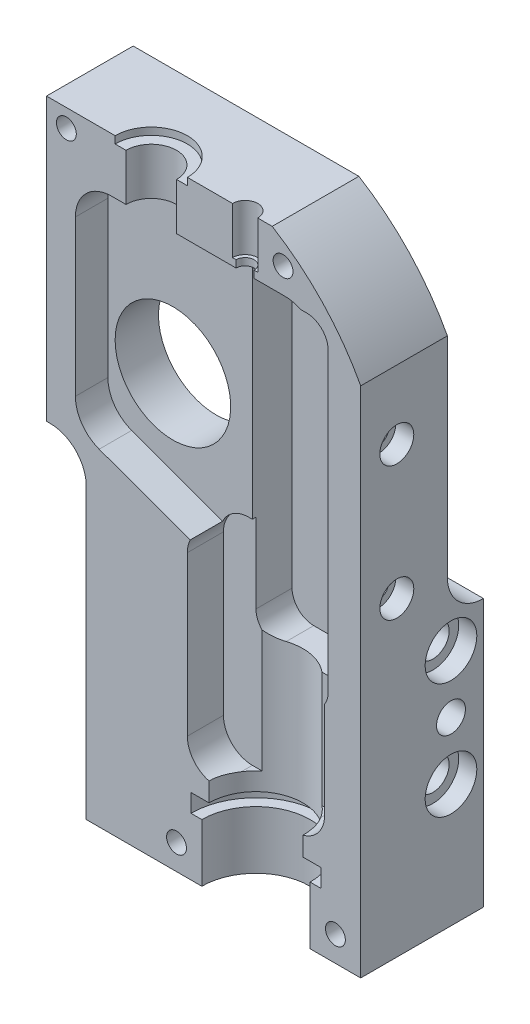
ISO-10303-21;
HEADER;
FILE_DESCRIPTION(('STEP AP214'),'2;1');
FILE_NAME('part.step','',(''),(''),'','','');
FILE_SCHEMA(('AUTOMOTIVE_DESIGN { 1 0 10303 214 1 1 1 1 }'));
ENDSEC;
DATA;
#1=APPLICATION_CONTEXT('core data for automotive mechanical design processes');
#2=APPLICATION_PROTOCOL_DEFINITION('international standard','automotive_design',2000,#1);
#3=PRODUCT_CONTEXT('',#1,'mechanical');
#4=PRODUCT('Part','Part','',(#3));
#5=PRODUCT_RELATED_PRODUCT_CATEGORY('part','',(#4));
#6=PRODUCT_DEFINITION_FORMATION('','',#4);
#7=PRODUCT_DEFINITION_CONTEXT('part definition',#1,'design');
#8=PRODUCT_DEFINITION('design','',#6,#7);
#9=PRODUCT_DEFINITION_SHAPE('','',#8);
#10=(LENGTH_UNIT() NAMED_UNIT(*) SI_UNIT(.MILLI.,.METRE.));
#11=(NAMED_UNIT(*) PLANE_ANGLE_UNIT() SI_UNIT($,.RADIAN.));
#12=(NAMED_UNIT(*) SI_UNIT($,.STERADIAN.) SOLID_ANGLE_UNIT());
#13=UNCERTAINTY_MEASURE_WITH_UNIT(LENGTH_MEASURE(1.E-05),#10,'distance_accuracy_value','');
#14=(GEOMETRIC_REPRESENTATION_CONTEXT(3) GLOBAL_UNCERTAINTY_ASSIGNED_CONTEXT((#13)) GLOBAL_UNIT_ASSIGNED_CONTEXT((#10,
#11,#12)) REPRESENTATION_CONTEXT('',''));
#15=CARTESIAN_POINT('',(0.,0.,0.));
#16=DIRECTION('',(0.,0.,1.));
#17=DIRECTION('',(1.,0.,0.));
#18=AXIS2_PLACEMENT_3D('',#15,#16,#17);
#19=CARTESIAN_POINT('',(20.,183.,-20.));
#20=DIRECTION('',(1.,0.,0.));
#21=DIRECTION('',(0.,1.,0.));
#22=AXIS2_PLACEMENT_3D('',#19,#20,#21);
#23=PLANE('',#22);
#24=CARTESIAN_POINT('',(20.,160.,-10.));
#25=DIRECTION('',(1.,0.,0.));
#26=DIRECTION('',(0.,1.,0.));
#27=AXIS2_PLACEMENT_3D('',#24,#25,#26);
#28=CIRCLE('',#27,2.75);
#29=CARTESIAN_POINT('',(20.,162.75,-10.));
#30=VERTEX_POINT('',#29);
#31=EDGE_CURVE('E1213',#30,#30,#28,.F.);
#32=ORIENTED_EDGE('',*,*,#31,.F.);
#33=EDGE_LOOP('',(#32));
#34=FACE_BOUND('',#33,.T.);
#35=DIRECTION('',(0.,1.,0.));
#36=VECTOR('',#35,1.);
#37=CARTESIAN_POINT('',(20.,183.,0.));
#38=LINE('',#37,#36);
#39=CARTESIAN_POINT('',(20.,101.,0.));
#40=VERTEX_POINT('',#39);
#41=CARTESIAN_POINT('',(20.,183.,0.));
#42=VERTEX_POINT('',#41);
#43=EDGE_CURVE('E1335',#40,#42,#38,.T.);
#44=ORIENTED_EDGE('',*,*,#43,.T.);
#45=DIRECTION('',(0.,0.,1.));
#46=VECTOR('',#45,1.);
#47=CARTESIAN_POINT('',(20.,183.,-20.));
#48=LINE('',#47,#46);
#49=CARTESIAN_POINT('',(20.,183.,-20.));
#50=VERTEX_POINT('',#49);
#51=EDGE_CURVE('E971',#50,#42,#48,.T.);
#52=ORIENTED_EDGE('',*,*,#51,.F.);
#53=DIRECTION('',(0.,1.,0.));
#54=VECTOR('',#53,1.);
#55=CARTESIAN_POINT('',(20.,183.,-20.));
#56=LINE('',#55,#54);
#57=CARTESIAN_POINT('',(20.,101.,-20.));
#58=VERTEX_POINT('',#57);
#59=EDGE_CURVE('E967',#58,#50,#56,.T.);
#60=ORIENTED_EDGE('',*,*,#59,.F.);
#61=DIRECTION('',(0.,0.,1.));
#62=VECTOR('',#61,1.);
#63=CARTESIAN_POINT('',(20.,101.,-20.));
#64=LINE('',#63,#62);
#65=EDGE_CURVE('E954',#58,#40,#64,.T.);
#66=ORIENTED_EDGE('',*,*,#65,.T.);
#67=EDGE_LOOP('',(#44,#52,#60,#66));
#68=FACE_BOUND('',#67,.T.);
#69=CARTESIAN_POINT('',(20.,123.,-10.));
#70=DIRECTION('',(1.,0.,0.));
#71=DIRECTION('',(0.,1.,0.));
#72=AXIS2_PLACEMENT_3D('',#69,#70,#71);
#73=CIRCLE('',#72,2.75);
#74=CARTESIAN_POINT('',(20.,125.75,-10.));
#75=VERTEX_POINT('',#74);
#76=EDGE_CURVE('E1201',#75,#75,#73,.F.);
#77=ORIENTED_EDGE('',*,*,#76,.F.);
#78=EDGE_LOOP('',(#77));
#79=FACE_BOUND('',#78,.T.);
#80=ADVANCED_FACE('F351',(#34,#68,#79),#23,.F.);
#81=CARTESIAN_POINT('',(-31.,147.,0.));
#82=DIRECTION('',(0.,0.,1.));
#83=DIRECTION('',(1.,0.,0.));
#84=AXIS2_PLACEMENT_3D('',#81,#82,#83);
#85=PLANE('',#84);
#86=CARTESIAN_POINT('',(-52.5,200.,0.));
#87=DIRECTION('',(0.,0.,-1.));
#88=DIRECTION('',(-1.,0.,0.));
#89=AXIS2_PLACEMENT_3D('',#86,#87,#88);
#90=CIRCLE('',#89,2.75);
#91=CARTESIAN_POINT('',(-55.25,200.,0.));
#92=VERTEX_POINT('',#91);
#93=EDGE_CURVE('E1252',#92,#92,#90,.T.);
#94=ORIENTED_EDGE('',*,*,#93,.T.);
#95=EDGE_LOOP('',(#94));
#96=FACE_BOUND('',#95,.T.);
#97=DIRECTION('',(0.,1.,0.));
#98=VECTOR('',#97,1.);
#99=CARTESIAN_POINT('',(-39.,212.,0.));
#100=LINE('',#99,#98);
#101=CARTESIAN_POINT('',(-39.,205.,0.));
#102=VERTEX_POINT('',#101);
#103=CARTESIAN_POINT('',(-39.,203.,0.));
#104=VERTEX_POINT('',#103);
#105=EDGE_CURVE('E1170',#102,#104,#100,.F.);
#106=ORIENTED_EDGE('',*,*,#105,.F.);
#107=DIRECTION('',(-1.,0.,0.));
#108=VECTOR('',#107,1.);
#109=CARTESIAN_POINT('',(4.49647869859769,205.,0.));
#110=LINE('',#109,#108);
#111=CARTESIAN_POINT('',(-58.,205.,0.));
#112=VERTEX_POINT('',#111);
#113=EDGE_CURVE('E996',#102,#112,#110,.T.);
#114=ORIENTED_EDGE('',*,*,#113,.T.);
#115=DIRECTION('',(0.,-1.,0.));
#116=VECTOR('',#115,1.);
#117=CARTESIAN_POINT('',(-58.,205.,0.));
#118=LINE('',#117,#116);
#119=CARTESIAN_POINT('',(-58.,127.,0.));
#120=VERTEX_POINT('',#119);
#121=EDGE_CURVE('E1000',#112,#120,#118,.T.);
#122=ORIENTED_EDGE('',*,*,#121,.T.);
#123=DIRECTION('',(1.,0.,0.));
#124=VECTOR('',#123,1.);
#125=CARTESIAN_POINT('',(-58.,127.,0.));
#126=LINE('',#125,#124);
#127=CARTESIAN_POINT('',(-57.0000000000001,127.,0.));
#128=VERTEX_POINT('',#127);
#129=EDGE_CURVE('E1004',#120,#128,#126,.T.);
#130=ORIENTED_EDGE('',*,*,#129,.T.);
#131=CARTESIAN_POINT('',(-57.,117.,0.));
#132=DIRECTION('',(0.,0.,-1.));
#133=DIRECTION('',(1.,0.,0.));
#134=AXIS2_PLACEMENT_3D('',#131,#132,#133);
#135=CIRCLE('',#134,10.);
#136=CARTESIAN_POINT('',(-47.,117.,0.));
#137=VERTEX_POINT('',#136);
#138=EDGE_CURVE('E1007',#128,#137,#135,.T.);
#139=ORIENTED_EDGE('',*,*,#138,.T.);
#140=DIRECTION('',(0.,-1.,0.));
#141=VECTOR('',#140,1.);
#142=CARTESIAN_POINT('',(-47.,117.,0.));
#143=LINE('',#142,#141);
#144=CARTESIAN_POINT('',(-47.,37.,0.));
#145=VERTEX_POINT('',#144);
#146=EDGE_CURVE('E983',#137,#145,#143,.T.);
#147=ORIENTED_EDGE('',*,*,#146,.T.);
#148=DIRECTION('',(1.,0.,0.));
#149=VECTOR('',#148,1.);
#150=CARTESIAN_POINT('',(-47.,37.,0.));
#151=LINE('',#150,#149);
#152=CARTESIAN_POINT('',(-15.,37.,0.));
#153=VERTEX_POINT('',#152);
#154=EDGE_CURVE('E987',#145,#153,#151,.T.);
#155=ORIENTED_EDGE('',*,*,#154,.T.);
#156=DIRECTION('',(0.,-1.,0.));
#157=VECTOR('',#156,1.);
#158=CARTESIAN_POINT('',(-15.,36.,0.));
#159=LINE('',#158,#157);
#160=CARTESIAN_POINT('',(-15.,53.,0.));
#161=VERTEX_POINT('',#160);
#162=EDGE_CURVE('E862',#161,#153,#159,.T.);
#163=ORIENTED_EDGE('',*,*,#162,.F.);
#164=DIRECTION('',(1.,0.,0.));
#165=VECTOR('',#164,1.);
#166=CARTESIAN_POINT('',(-31.,53.,0.));
#167=LINE('',#166,#165);
#168=CARTESIAN_POINT('',(-18.,53.,0.));
#169=VERTEX_POINT('',#168);
#170=EDGE_CURVE('E1040',#169,#161,#167,.T.);
#171=ORIENTED_EDGE('',*,*,#170,.F.);
#172=DIRECTION('',(0.,-1.,0.));
#173=VECTOR('',#172,1.);
#174=CARTESIAN_POINT('',(-18.,36.,0.));
#175=LINE('',#174,#173);
#176=CARTESIAN_POINT('',(-18.,58.,0.));
#177=VERTEX_POINT('',#176);
#178=EDGE_CURVE('E1048',#177,#169,#175,.T.);
#179=ORIENTED_EDGE('',*,*,#178,.F.);
#180=DIRECTION('',(-1.,0.,0.));
#181=VECTOR('',#180,1.);
#182=CARTESIAN_POINT('',(-31.,58.,0.));
#183=LINE('',#182,#181);
#184=CARTESIAN_POINT('',(-13.,58.,0.));
#185=VERTEX_POINT('',#184);
#186=EDGE_CURVE('E1045',#185,#177,#183,.T.);
#187=ORIENTED_EDGE('',*,*,#186,.F.);
#188=DIRECTION('',(0.,-1.,0.));
#189=VECTOR('',#188,1.);
#190=CARTESIAN_POINT('',(-13.,36.,0.));
#191=LINE('',#190,#189);
#192=CARTESIAN_POINT('',(-13.,63.2540333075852,0.));
#193=VERTEX_POINT('',#192);
#194=EDGE_CURVE('E1047',#193,#185,#191,.T.);
#195=ORIENTED_EDGE('',*,*,#194,.F.);
#196=CARTESIAN_POINT('',(-11.,71.,0.));
#197=DIRECTION('',(0.,0.,1.));
#198=DIRECTION('',(-1.,0.,0.));
#199=AXIS2_PLACEMENT_3D('',#196,#197,#198);
#200=CIRCLE('',#199,8.);
#201=CARTESIAN_POINT('',(-19.,71.,0.));
#202=VERTEX_POINT('',#201);
#203=EDGE_CURVE('E742',#202,#193,#200,.T.);
#204=ORIENTED_EDGE('',*,*,#203,.F.);
#205=DIRECTION('',(0.,-1.,0.));
#206=VECTOR('',#205,1.);
#207=CARTESIAN_POINT('',(-19.,71.,0.));
#208=LINE('',#207,#206);
#209=CARTESIAN_POINT('',(-19.,115.,0.));
#210=VERTEX_POINT('',#209);
#211=EDGE_CURVE('E739',#210,#202,#208,.T.);
#212=ORIENTED_EDGE('',*,*,#211,.F.);
#213=CARTESIAN_POINT('',(-11.,115.,0.));
#214=DIRECTION('',(0.,0.,1.));
#215=DIRECTION('',(-1.,0.,0.));
#216=AXIS2_PLACEMENT_3D('',#213,#214,#215);
#217=CIRCLE('',#216,8.00000000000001);
#218=CARTESIAN_POINT('',(-18.2259122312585,118.433102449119,0.));
#219=VERTEX_POINT('',#218);
#220=EDGE_CURVE('E737',#219,#210,#217,.T.);
#221=ORIENTED_EDGE('',*,*,#220,.F.);
#222=DIRECTION('',(0.93969262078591,-0.342020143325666,0.));
#223=VECTOR('',#222,1.);
#224=CARTESIAN_POINT('',(-43.4202014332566,127.603073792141,0.));
#225=LINE('',#224,#223);
#226=CARTESIAN_POINT('',(-43.4202014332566,127.603073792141,0.));
#227=VERTEX_POINT('',#226);
#228=EDGE_CURVE('E1137',#227,#219,#225,.T.);
#229=ORIENTED_EDGE('',*,*,#228,.F.);
#230=CARTESIAN_POINT('',(-40.,137.,0.));
#231=DIRECTION('',(0.,0.,1.));
#232=DIRECTION('',(-1.,0.,0.));
#233=AXIS2_PLACEMENT_3D('',#230,#231,#232);
#234=CIRCLE('',#233,10.);
#235=CARTESIAN_POINT('',(-50.,137.,0.));
#236=VERTEX_POINT('',#235);
#237=EDGE_CURVE('E1135',#236,#227,#234,.T.);
#238=ORIENTED_EDGE('',*,*,#237,.F.);
#239=DIRECTION('',(0.,-1.,0.));
#240=VECTOR('',#239,1.);
#241=CARTESIAN_POINT('',(-50.,180.,0.));
#242=LINE('',#241,#240);
#243=CARTESIAN_POINT('',(-50.,180.,0.));
#244=VERTEX_POINT('',#243);
#245=EDGE_CURVE('E694',#244,#236,#242,.T.);
#246=ORIENTED_EDGE('',*,*,#245,.F.);
#247=CARTESIAN_POINT('',(-40.,180.,0.));
#248=DIRECTION('',(0.,0.,1.));
#249=DIRECTION('',(-1.,0.,0.));
#250=AXIS2_PLACEMENT_3D('',#247,#248,#249);
#251=CIRCLE('',#250,9.99999999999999);
#252=CARTESIAN_POINT('',(-40.,190.,0.));
#253=VERTEX_POINT('',#252);
#254=EDGE_CURVE('E687',#253,#244,#251,.T.);
#255=ORIENTED_EDGE('',*,*,#254,.F.);
#256=DIRECTION('',(-1.,0.,0.));
#257=VECTOR('',#256,1.);
#258=CARTESIAN_POINT('',(7.99999999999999,190.,0.));
#259=LINE('',#258,#257);
#260=CARTESIAN_POINT('',(-36.,190.,0.));
#261=VERTEX_POINT('',#260);
#262=EDGE_CURVE('E685',#261,#253,#259,.T.);
#263=ORIENTED_EDGE('',*,*,#262,.F.);
#264=DIRECTION('',(0.,1.,0.));
#265=VECTOR('',#264,1.);
#266=CARTESIAN_POINT('',(-36.,212.,0.));
#267=LINE('',#266,#265);
#268=CARTESIAN_POINT('',(-36.,203.,0.));
#269=VERTEX_POINT('',#268);
#270=EDGE_CURVE('E368',#269,#261,#267,.F.);
#271=ORIENTED_EDGE('',*,*,#270,.F.);
#272=DIRECTION('',(1.,0.,0.));
#273=VECTOR('',#272,1.);
#274=CARTESIAN_POINT('',(-31.,203.,0.));
#275=LINE('',#274,#273);
#276=EDGE_CURVE('E670',#104,#269,#275,.T.);
#277=ORIENTED_EDGE('',*,*,#276,.F.);
#278=EDGE_LOOP('',(#106,#114,#122,#130,#139,#147,#155,#163,#171,#179,#187,#195,#204,#212,#221,
#229,#238,#246,#255,#263,#271,#277));
#279=FACE_BOUND('',#278,.T.);
#280=CARTESIAN_POINT('',(-22.,44.,0.));
#281=DIRECTION('',(0.,0.,-1.));
#282=DIRECTION('',(-1.,0.,0.));
#283=AXIS2_PLACEMENT_3D('',#280,#281,#282);
#284=CIRCLE('',#283,2.74999999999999);
#285=CARTESIAN_POINT('',(-24.75,44.,0.));
#286=VERTEX_POINT('',#285);
#287=EDGE_CURVE('E1216',#286,#286,#284,.T.);
#288=ORIENTED_EDGE('',*,*,#287,.T.);
#289=EDGE_LOOP('',(#288));
#290=FACE_BOUND('',#289,.T.);
#291=ADVANCED_FACE('F833',(#96,#279,#290),#85,.T.);
#292=CARTESIAN_POINT('',(7.5,197.,0.));
#293=DIRECTION('',(0.,0.,-1.));
#294=DIRECTION('',(-1.,0.,0.));
#295=AXIS2_PLACEMENT_3D('',#292,#293,#294);
#296=CIRCLE('',#295,2.74999999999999);
#297=CARTESIAN_POINT('',(4.75000000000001,197.,0.));
#298=VERTEX_POINT('',#297);
#299=EDGE_CURVE('E1240',#298,#298,#296,.T.);
#300=ORIENTED_EDGE('',*,*,#299,.T.);
#301=EDGE_LOOP('',(#300));
#302=FACE_BOUND('',#301,.T.);
#303=DIRECTION('',(0.,1.,0.));
#304=VECTOR('',#303,1.);
#305=CARTESIAN_POINT('',(0.5,211.,0.));
#306=LINE('',#305,#304);
#307=CARTESIAN_POINT('',(0.500000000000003,192.,0.));
#308=VERTEX_POINT('',#307);
#309=CARTESIAN_POINT('',(0.500000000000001,205.,0.));
#310=VERTEX_POINT('',#309);
#311=EDGE_CURVE('E671',#308,#310,#306,.T.);
#312=ORIENTED_EDGE('',*,*,#311,.F.);
#313=DIRECTION('',(1.,0.,0.));
#314=VECTOR('',#313,1.);
#315=CARTESIAN_POINT('',(-31.,192.,0.));
#316=LINE('',#315,#314);
#317=CARTESIAN_POINT('',(-0.499999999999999,192.,0.));
#318=VERTEX_POINT('',#317);
#319=EDGE_CURVE('E1155',#318,#308,#316,.T.);
#320=ORIENTED_EDGE('',*,*,#319,.F.);
#321=DIRECTION('',(0.,1.,0.));
#322=VECTOR('',#321,1.);
#323=CARTESIAN_POINT('',(-0.500000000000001,211.,0.));
#324=LINE('',#323,#322);
#325=CARTESIAN_POINT('',(-0.499999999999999,190.,0.));
#326=VERTEX_POINT('',#325);
#327=EDGE_CURVE('E1113',#326,#318,#324,.T.);
#328=ORIENTED_EDGE('',*,*,#327,.F.);
#329=CARTESIAN_POINT('',(7.99999999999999,190.,0.));
#330=VERTEX_POINT('',#329);
#331=EDGE_CURVE('E684',#330,#326,#259,.T.);
#332=ORIENTED_EDGE('',*,*,#331,.F.);
#333=CARTESIAN_POINT('',(8.,180.,0.));
#334=DIRECTION('',(0.,0.,1.));
#335=DIRECTION('',(-1.,0.,0.));
#336=AXIS2_PLACEMENT_3D('',#333,#334,#335);
#337=CIRCLE('',#336,10.);
#338=CARTESIAN_POINT('',(12.3588989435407,189.,0.));
#339=VERTEX_POINT('',#338);
#340=EDGE_CURVE('E688',#339,#330,#337,.T.);
#341=ORIENTED_EDGE('',*,*,#340,.F.);
#342=DIRECTION('',(-1.,0.,0.));
#343=VECTOR('',#342,1.);
#344=CARTESIAN_POINT('',(-4.,189.,0.));
#345=LINE('',#344,#343);
#346=CARTESIAN_POINT('',(14.,189.,0.));
#347=VERTEX_POINT('',#346);
#348=EDGE_CURVE('E1292',#347,#339,#345,.T.);
#349=ORIENTED_EDGE('',*,*,#348,.F.);
#350=CARTESIAN_POINT('',(14.,183.,0.));
#351=DIRECTION('',(0.,0.,1.));
#352=DIRECTION('',(-1.,0.,0.));
#353=AXIS2_PLACEMENT_3D('',#350,#351,#352);
#354=CIRCLE('',#353,6.);
#355=EDGE_CURVE('E1323',#42,#347,#354,.T.);
#356=ORIENTED_EDGE('',*,*,#355,.F.);
#357=ORIENTED_EDGE('',*,*,#43,.F.);
#358=CARTESIAN_POINT('',(14.,101.,0.));
#359=DIRECTION('',(0.,0.,1.));
#360=DIRECTION('',(-1.,0.,0.));
#361=AXIS2_PLACEMENT_3D('',#358,#359,#360);
#362=CIRCLE('',#361,6.);
#363=CARTESIAN_POINT('',(19.,97.6833752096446,0.));
#364=VERTEX_POINT('',#363);
#365=EDGE_CURVE('E1333',#364,#40,#362,.T.);
#366=ORIENTED_EDGE('',*,*,#365,.F.);
#367=DIRECTION('',(0.,1.,0.));
#368=VECTOR('',#367,1.);
#369=CARTESIAN_POINT('',(19.,71.,0.));
#370=LINE('',#369,#368);
#371=CARTESIAN_POINT('',(19.,71.,0.));
#372=VERTEX_POINT('',#371);
#373=EDGE_CURVE('E746',#372,#364,#370,.T.);
#374=ORIENTED_EDGE('',*,*,#373,.F.);
#375=CARTESIAN_POINT('',(11.,71.,0.));
#376=DIRECTION('',(0.,0.,1.));
#377=DIRECTION('',(-1.,0.,0.));
#378=AXIS2_PLACEMENT_3D('',#375,#376,#377);
#379=CIRCLE('',#378,8.);
#380=CARTESIAN_POINT('',(13.,63.2540333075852,0.));
#381=VERTEX_POINT('',#380);
#382=EDGE_CURVE('E744',#381,#372,#379,.T.);
#383=ORIENTED_EDGE('',*,*,#382,.F.);
#384=DIRECTION('',(0.,-1.,0.));
#385=VECTOR('',#384,1.);
#386=CARTESIAN_POINT('',(13.,36.,0.));
#387=LINE('',#386,#385);
#388=CARTESIAN_POINT('',(13.,58.,0.));
#389=VERTEX_POINT('',#388);
#390=EDGE_CURVE('E1044',#389,#381,#387,.F.);
#391=ORIENTED_EDGE('',*,*,#390,.F.);
#392=CARTESIAN_POINT('',(18.,58.,0.));
#393=VERTEX_POINT('',#392);
#394=EDGE_CURVE('E1042',#393,#389,#183,.T.);
#395=ORIENTED_EDGE('',*,*,#394,.F.);
#396=DIRECTION('',(0.,-1.,0.));
#397=VECTOR('',#396,1.);
#398=CARTESIAN_POINT('',(18.,36.,0.));
#399=LINE('',#398,#397);
#400=CARTESIAN_POINT('',(18.,53.,0.));
#401=VERTEX_POINT('',#400);
#402=EDGE_CURVE('E1039',#401,#393,#399,.F.);
#403=ORIENTED_EDGE('',*,*,#402,.F.);
#404=CARTESIAN_POINT('',(15.,53.,0.));
#405=VERTEX_POINT('',#404);
#406=EDGE_CURVE('E1037',#405,#401,#167,.T.);
#407=ORIENTED_EDGE('',*,*,#406,.F.);
#408=DIRECTION('',(0.,-1.,0.));
#409=VECTOR('',#408,1.);
#410=CARTESIAN_POINT('',(15.,36.,0.));
#411=LINE('',#410,#409);
#412=CARTESIAN_POINT('',(15.,37.,0.));
#413=VERTEX_POINT('',#412);
#414=EDGE_CURVE('E1020',#413,#405,#411,.F.);
#415=ORIENTED_EDGE('',*,*,#414,.F.);
#416=CARTESIAN_POINT('',(29.,37.,0.));
#417=VERTEX_POINT('',#416);
#418=EDGE_CURVE('E986',#413,#417,#151,.T.);
#419=ORIENTED_EDGE('',*,*,#418,.T.);
#420=DIRECTION('',(0.,1.,0.));
#421=VECTOR('',#420,1.);
#422=CARTESIAN_POINT('',(29.,37.,0.));
#423=LINE('',#422,#421);
#424=CARTESIAN_POINT('',(29.,179.,0.));
#425=VERTEX_POINT('',#424);
#426=EDGE_CURVE('E990',#417,#425,#423,.T.);
#427=ORIENTED_EDGE('',*,*,#426,.T.);
#428=CARTESIAN_POINT('',(-31.,147.,0.));
#429=DIRECTION('',(0.,0.,1.));
#430=DIRECTION('',(1.,0.,0.));
#431=AXIS2_PLACEMENT_3D('',#428,#429,#430);
#432=CIRCLE('',#431,68.);
#433=CARTESIAN_POINT('',(4.49647869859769,205.,0.));
#434=VERTEX_POINT('',#433);
#435=EDGE_CURVE('E993',#425,#434,#432,.T.);
#436=ORIENTED_EDGE('',*,*,#435,.T.);
#437=EDGE_CURVE('E997',#434,#310,#110,.T.);
#438=ORIENTED_EDGE('',*,*,#437,.T.);
#439=EDGE_LOOP('',(#312,#320,#328,#332,#341,#349,#356,#357,#366,#374,#383,#391,#395,#403,#407,
#415,#419,#427,#436,#438));
#440=FACE_BOUND('',#439,.T.);
#441=CARTESIAN_POINT('',(22.,44.,0.));
#442=DIRECTION('',(0.,0.,-1.));
#443=DIRECTION('',(-1.,0.,0.));
#444=AXIS2_PLACEMENT_3D('',#441,#442,#443);
#445=CIRCLE('',#444,2.74999999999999);
#446=CARTESIAN_POINT('',(19.25,44.,0.));
#447=VERTEX_POINT('',#446);
#448=EDGE_CURVE('E1228',#447,#447,#445,.T.);
#449=ORIENTED_EDGE('',*,*,#448,.T.);
#450=EDGE_LOOP('',(#449));
#451=FACE_BOUND('',#450,.T.);
#452=ADVANCED_FACE('F1075',(#302,#440,#451),#85,.T.);
#453=DIRECTION('',(0.,1.,0.));
#454=VECTOR('',#453,1.);
#455=CARTESIAN_POINT('',(-19.,212.,0.));
#456=LINE('',#455,#454);
#457=CARTESIAN_POINT('',(-19.,203.,0.));
#458=VERTEX_POINT('',#457);
#459=CARTESIAN_POINT('',(-19.,205.,0.));
#460=VERTEX_POINT('',#459);
#461=EDGE_CURVE('E11',#458,#460,#456,.T.);
#462=ORIENTED_EDGE('',*,*,#461,.F.);
#463=CARTESIAN_POINT('',(-22.,203.,0.));
#464=VERTEX_POINT('',#463);
#465=EDGE_CURVE('E360',#464,#458,#275,.T.);
#466=ORIENTED_EDGE('',*,*,#465,.F.);
#467=DIRECTION('',(0.,1.,0.));
#468=VECTOR('',#467,1.);
#469=CARTESIAN_POINT('',(-22.,212.,0.));
#470=LINE('',#469,#468);
#471=CARTESIAN_POINT('',(-22.,190.,0.));
#472=VERTEX_POINT('',#471);
#473=EDGE_CURVE('E665',#472,#464,#470,.T.);
#474=ORIENTED_EDGE('',*,*,#473,.F.);
#475=CARTESIAN_POINT('',(-5.5,190.,0.));
#476=VERTEX_POINT('',#475);
#477=EDGE_CURVE('E678',#476,#472,#259,.T.);
#478=ORIENTED_EDGE('',*,*,#477,.F.);
#479=DIRECTION('',(0.,1.,0.));
#480=VECTOR('',#479,1.);
#481=CARTESIAN_POINT('',(-5.5,211.,0.));
#482=LINE('',#481,#480);
#483=CARTESIAN_POINT('',(-5.5,192.,0.));
#484=VERTEX_POINT('',#483);
#485=EDGE_CURVE('E376',#484,#476,#482,.F.);
#486=ORIENTED_EDGE('',*,*,#485,.F.);
#487=CARTESIAN_POINT('',(-6.5,192.,0.));
#488=VERTEX_POINT('',#487);
#489=EDGE_CURVE('E1162',#488,#484,#316,.T.);
#490=ORIENTED_EDGE('',*,*,#489,.F.);
#491=DIRECTION('',(0.,1.,0.));
#492=VECTOR('',#491,1.);
#493=CARTESIAN_POINT('',(-6.5,211.,0.));
#494=LINE('',#493,#492);
#495=CARTESIAN_POINT('',(-6.5,205.,0.));
#496=VERTEX_POINT('',#495);
#497=EDGE_CURVE('E1163',#496,#488,#494,.F.);
#498=ORIENTED_EDGE('',*,*,#497,.F.);
#499=EDGE_CURVE('E1001',#496,#460,#110,.T.);
#500=ORIENTED_EDGE('',*,*,#499,.T.);
#501=EDGE_LOOP('',(#462,#466,#474,#478,#486,#490,#498,#500));
#502=FACE_BOUND('',#501,.T.);
#503=ADVANCED_FACE('F677',(#502),#85,.T.);
#504=CARTESIAN_POINT('',(-47.,117.,-34.));
#505=DIRECTION('',(-1.,0.,0.));
#506=DIRECTION('',(0.,-1.,0.));
#507=AXIS2_PLACEMENT_3D('',#504,#505,#506);
#508=PLANE('',#507);
#509=CARTESIAN_POINT('',(-47.,87.,-25.));
#510=DIRECTION('',(-1.,0.,0.));
#511=DIRECTION('',(0.,-1.,0.));
#512=AXIS2_PLACEMENT_3D('',#509,#510,#511);
#513=CIRCLE('',#512,2.99999999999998);
#514=CARTESIAN_POINT('',(-47.,84.,-25.));
#515=VERTEX_POINT('',#514);
#516=EDGE_CURVE('E1176',#515,#515,#513,.T.);
#517=ORIENTED_EDGE('',*,*,#516,.F.);
#518=EDGE_LOOP('',(#517));
#519=FACE_BOUND('',#518,.T.);
#520=CARTESIAN_POINT('',(-47.,71.,-25.));
#521=DIRECTION('',(-1.,0.,0.));
#522=DIRECTION('',(0.,-1.,0.));
#523=AXIS2_PLACEMENT_3D('',#520,#521,#522);
#524=CIRCLE('',#523,4.49999999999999);
#525=CARTESIAN_POINT('',(-47.,66.5,-25.));
#526=VERTEX_POINT('',#525);
#527=EDGE_CURVE('E1124',#526,#526,#524,.T.);
#528=ORIENTED_EDGE('',*,*,#527,.F.);
#529=EDGE_LOOP('',(#528));
#530=FACE_BOUND('',#529,.T.);
#531=CARTESIAN_POINT('',(-47.,103.,-25.));
#532=DIRECTION('',(-1.,0.,0.));
#533=DIRECTION('',(0.,-1.,0.));
#534=AXIS2_PLACEMENT_3D('',#531,#532,#533);
#535=CIRCLE('',#534,4.49999999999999);
#536=CARTESIAN_POINT('',(-47.,98.5,-25.));
#537=VERTEX_POINT('',#536);
#538=EDGE_CURVE('E1134',#537,#537,#535,.T.);
#539=ORIENTED_EDGE('',*,*,#538,.F.);
#540=EDGE_LOOP('',(#539));
#541=FACE_BOUND('',#540,.T.);
#542=CARTESIAN_POINT('',(-47.,121.,-34.));
#543=DIRECTION('',(-1.,0.,0.));
#544=DIRECTION('',(0.,-1.,0.));
#545=AXIS2_PLACEMENT_3D('',#542,#543,#544);
#546=CIRCLE('',#545,10.);
#547=CARTESIAN_POINT('',(-47.,111.,-34.));
#548=VERTEX_POINT('',#547);
#549=CARTESIAN_POINT('',(-47.,117.,-24.8348486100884));
#550=VERTEX_POINT('',#549);
#551=EDGE_CURVE('E811',#548,#550,#546,.T.);
#552=ORIENTED_EDGE('',*,*,#551,.F.);
#553=DIRECTION('',(0.,-1.,0.));
#554=VECTOR('',#553,1.);
#555=CARTESIAN_POINT('',(-47.,117.,-34.));
#556=LINE('',#555,#554);
#557=CARTESIAN_POINT('',(-47.,37.,-34.));
#558=VERTEX_POINT('',#557);
#559=EDGE_CURVE('E1010',#548,#558,#556,.T.);
#560=ORIENTED_EDGE('',*,*,#559,.T.);
#561=DIRECTION('',(0.,0.,1.));
#562=VECTOR('',#561,1.);
#563=CARTESIAN_POINT('',(-47.,37.,-34.));
#564=LINE('',#563,#562);
#565=EDGE_CURVE('E1017',#558,#145,#564,.T.);
#566=ORIENTED_EDGE('',*,*,#565,.T.);
#567=ORIENTED_EDGE('',*,*,#146,.F.);
#568=DIRECTION('',(0.,0.,1.));
#569=VECTOR('',#568,1.);
#570=CARTESIAN_POINT('',(-47.,117.,-34.));
#571=LINE('',#570,#569);
#572=EDGE_CURVE('E1018',#550,#137,#571,.T.);
#573=ORIENTED_EDGE('',*,*,#572,.F.);
#574=EDGE_LOOP('',(#552,#560,#566,#567,#573));
#575=FACE_BOUND('',#574,.T.);
#576=ADVANCED_FACE('F353',(#519,#530,#541,#575),#508,.T.);
#577=CARTESIAN_POINT('',(-57.,117.,-34.));
#578=DIRECTION('',(0.,0.,1.));
#579=DIRECTION('',(1.,0.,0.));
#580=AXIS2_PLACEMENT_3D('',#577,#578,#579);
#581=CYLINDRICAL_SURFACE('',#580,10.);
#582=CARTESIAN_POINT('',(-47.,117.,-43.1651513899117));
#583=CARTESIAN_POINT('',(-47.0000023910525,116.764192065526,-43.0622330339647));
#584=CARTESIAN_POINT('',(-47.0083580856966,116.532319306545,-42.9501812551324));
#585=CARTESIAN_POINT('',(-47.0399343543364,116.078664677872,-42.7089913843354));
#586=CARTESIAN_POINT('',(-47.0631607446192,115.856886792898,-42.5798466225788));
#587=CARTESIAN_POINT('',(-47.1224266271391,115.424832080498,-42.3056042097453));
#588=CARTESIAN_POINT('',(-47.1584835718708,115.214571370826,-42.1604850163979));
#589=CARTESIAN_POINT('',(-47.2412070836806,114.807002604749,-41.8556727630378));
#590=CARTESIAN_POINT('',(-47.2878787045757,114.60970077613,-41.6959727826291));
#591=CARTESIAN_POINT('',(-47.3890874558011,114.230806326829,-41.3648290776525));
#592=CARTESIAN_POINT('',(-47.4435455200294,114.049082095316,-41.1935115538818));
#593=CARTESIAN_POINT('',(-47.5584318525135,113.699907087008,-40.838904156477));
#594=CARTESIAN_POINT('',(-47.6188597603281,113.532455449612,-40.6556150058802));
#595=CARTESIAN_POINT('',(-47.80595647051,113.051893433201,-40.0887533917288));
#596=CARTESIAN_POINT('',(-47.9384426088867,112.760560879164,-39.6881735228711));
#597=CARTESIAN_POINT('',(-48.1440970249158,112.352358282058,-39.0296458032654));
#598=CARTESIAN_POINT('',(-48.2182158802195,112.214419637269,-38.784652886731));
#599=CARTESIAN_POINT('',(-48.3622166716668,111.959153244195,-38.2827886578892));
#600=CARTESIAN_POINT('',(-48.4320979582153,111.841828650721,-38.0259155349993));
#601=CARTESIAN_POINT('',(-48.5639494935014,111.628897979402,-37.50176860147));
#602=CARTESIAN_POINT('',(-48.6259300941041,111.533263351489,-37.2345090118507));
#603=CARTESIAN_POINT('',(-48.7385064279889,111.36457344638,-36.6906374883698));
#604=CARTESIAN_POINT('',(-48.7891059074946,111.291510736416,-36.4140286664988));
#605=CARTESIAN_POINT('',(-48.8667263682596,111.18163264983,-35.9109370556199));
#606=CARTESIAN_POINT('',(-48.8964551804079,111.140455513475,-35.6858182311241));
#607=CARTESIAN_POINT('',(-48.9452523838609,111.073553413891,-35.2321532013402));
#608=CARTESIAN_POINT('',(-48.9643222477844,111.047826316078,-35.0036074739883));
#609=CARTESIAN_POINT('',(-48.9908301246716,111.012204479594,-34.5448201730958));
#610=CARTESIAN_POINT('',(-48.9982789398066,111.002295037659,-34.3145803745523));
#611=CARTESIAN_POINT('',(-49.0011889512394,110.998414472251,-33.8538829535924));
#612=CARTESIAN_POINT('',(-48.9966498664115,111.004443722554,-33.6234253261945));
#613=CARTESIAN_POINT('',(-48.9758327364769,111.032334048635,-33.1642387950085));
#614=CARTESIAN_POINT('',(-48.9595660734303,111.054179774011,-32.9355084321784));
#615=CARTESIAN_POINT('',(-48.9161341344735,111.113366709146,-32.4811240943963));
#616=CARTESIAN_POINT('',(-48.8889686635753,111.150708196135,-32.255470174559));
#617=CARTESIAN_POINT('',(-48.8250045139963,111.240444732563,-31.808400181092));
#618=CARTESIAN_POINT('',(-48.7881983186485,111.292851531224,-31.586987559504));
#619=CARTESIAN_POINT('',(-48.7065433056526,111.412174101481,-31.1495569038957));
#620=CARTESIAN_POINT('',(-48.6616913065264,111.479095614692,-30.9335410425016));
#621=CARTESIAN_POINT('',(-48.5630216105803,111.631011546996,-30.4959106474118));
#622=CARTESIAN_POINT('',(-48.5088436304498,111.716805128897,-30.2746546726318));
#623=CARTESIAN_POINT('',(-48.3955964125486,111.903318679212,-29.8399061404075));
#624=CARTESIAN_POINT('',(-48.3365271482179,112.004038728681,-29.6264136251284));
#625=CARTESIAN_POINT('',(-48.1549625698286,112.328113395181,-28.9979443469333));
#626=CARTESIAN_POINT('',(-48.0281498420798,112.573325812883,-28.5951381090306));
#627=CARTESIAN_POINT('',(-47.8287597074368,113.009886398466,-27.9801527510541));
#628=CARTESIAN_POINT('',(-47.7546626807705,113.183895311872,-27.7558500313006));
#629=CARTESIAN_POINT('',(-47.6114176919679,113.551323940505,-27.3218255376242));
#630=CARTESIAN_POINT('',(-47.5422707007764,113.744747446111,-27.1121066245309));
#631=CARTESIAN_POINT('',(-47.4123543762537,114.150033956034,-26.7089368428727));
#632=CARTESIAN_POINT('',(-47.3515762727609,114.361877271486,-26.5154690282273));
#633=CARTESIAN_POINT('',(-47.2416320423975,114.803204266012,-26.1461846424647));
#634=CARTESIAN_POINT('',(-47.1924616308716,115.032681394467,-25.9703615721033));
#635=CARTESIAN_POINT('',(-47.119262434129,115.449466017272,-25.6789772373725));
#636=CARTESIAN_POINT('',(-47.0920248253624,115.633290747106,-25.5592203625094));
#637=CARTESIAN_POINT('',(-47.0473963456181,116.009293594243,-25.3316025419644));
#638=CARTESIAN_POINT('',(-47.0300032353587,116.201469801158,-25.2237388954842));
#639=CARTESIAN_POINT('',(-47.0063653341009,116.592951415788,-25.0207740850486));
#640=CARTESIAN_POINT('',(-47.0001124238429,116.792251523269,-24.9256636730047));
#641=CARTESIAN_POINT('',(-46.9998906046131,117.196742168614,-24.7488410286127));
#642=CARTESIAN_POINT('',(-47.0059219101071,117.401932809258,-24.6671290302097));
#643=CARTESIAN_POINT('',(-47.0312971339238,117.817648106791,-24.5172944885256));
#644=CARTESIAN_POINT('',(-47.0507106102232,118.028195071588,-24.4492453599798));
#645=CARTESIAN_POINT('',(-47.1036315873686,118.451697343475,-24.3276328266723));
#646=CARTESIAN_POINT('',(-47.137139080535,118.664652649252,-24.2740694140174));
#647=CARTESIAN_POINT('',(-47.2186374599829,119.090941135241,-24.1814936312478));
#648=CARTESIAN_POINT('',(-47.2666275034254,119.304274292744,-24.1424804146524));
#649=CARTESIAN_POINT('',(-47.3771525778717,119.729288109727,-24.0787368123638));
#650=CARTESIAN_POINT('',(-47.439686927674,119.94096884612,-24.0540057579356));
#651=CARTESIAN_POINT('',(-47.5734301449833,120.343821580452,-24.0196714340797));
#652=CARTESIAN_POINT('',(-47.6435352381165,120.535272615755,-24.0090105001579));
#653=CARTESIAN_POINT('',(-47.7954633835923,120.913836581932,-23.9985779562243));
#654=CARTESIAN_POINT('',(-47.8772903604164,121.100948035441,-23.9988100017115));
#655=CARTESIAN_POINT('',(-48.0520999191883,121.469528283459,-24.0093277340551));
#656=CARTESIAN_POINT('',(-48.1450801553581,121.650998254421,-24.0196113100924));
#657=CARTESIAN_POINT('',(-48.3416338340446,122.007408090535,-24.0492650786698));
#658=CARTESIAN_POINT('',(-48.4452113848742,122.182345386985,-24.0686388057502));
#659=CARTESIAN_POINT('',(-48.6700774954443,122.537110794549,-24.1171059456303));
#660=CARTESIAN_POINT('',(-48.7921035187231,122.71638978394,-24.1467968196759));
#661=CARTESIAN_POINT('',(-49.0467745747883,123.065721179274,-24.2140678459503));
#662=CARTESIAN_POINT('',(-49.1794232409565,123.2357703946,-24.251650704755));
#663=CARTESIAN_POINT('',(-49.5921191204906,123.731115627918,-24.3741688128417));
#664=CARTESIAN_POINT('',(-49.8870167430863,124.041766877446,-24.4688973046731));
#665=CARTESIAN_POINT('',(-50.5708402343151,124.676149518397,-24.6930281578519));
#666=CARTESIAN_POINT('',(-50.9669606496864,124.991008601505,-24.8255968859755));
#667=CARTESIAN_POINT('',(-51.5927179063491,125.415763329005,-25.0263886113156));
#668=CARTESIAN_POINT('',(-51.8068444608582,125.549558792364,-25.09372487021));
#669=CARTESIAN_POINT('',(-52.2450901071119,125.80083008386,-25.2266193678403));
#670=CARTESIAN_POINT('',(-52.4692100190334,125.918304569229,-25.2921774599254));
#671=CARTESIAN_POINT('',(-52.9606782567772,126.152517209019,-25.4283867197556));
#672=CARTESIAN_POINT('',(-53.2295077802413,126.26656174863,-25.4983510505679));
#673=CARTESIAN_POINT('',(-53.7782457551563,126.471327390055,-25.6286605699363));
#674=CARTESIAN_POINT('',(-54.0581553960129,126.562045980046,-25.6890047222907));
#675=CARTESIAN_POINT('',(-54.6266165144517,126.71873074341,-25.7960300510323));
#676=CARTESIAN_POINT('',(-54.9151436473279,126.78476062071,-25.8427463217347));
#677=CARTESIAN_POINT('',(-55.4990823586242,126.891169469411,-25.9192532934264));
#678=CARTESIAN_POINT('',(-55.7944917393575,126.931556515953,-25.949049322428));
#679=CARTESIAN_POINT('',(-56.349625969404,126.98218889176,-25.9866206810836));
#680=CARTESIAN_POINT('',(-56.6088927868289,126.995718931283,-25.9967906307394));
#681=CARTESIAN_POINT('',(-57.1278388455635,127.002548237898,-26.0019098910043));
#682=CARTESIAN_POINT('',(-57.3875180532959,126.995849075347,-25.9968603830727));
#683=CARTESIAN_POINT('',(-57.9049569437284,126.962344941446,-25.9718703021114));
#684=CARTESIAN_POINT('',(-58.162715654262,126.93553040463,-25.9519226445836));
#685=CARTESIAN_POINT('',(-58.6739707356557,126.862277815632,-25.8984110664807));
#686=CARTESIAN_POINT('',(-58.9274670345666,126.815839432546,-25.8648469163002));
#687=CARTESIAN_POINT('',(-59.3991483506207,126.710586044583,-25.7906865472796));
#688=CARTESIAN_POINT('',(-59.6180034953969,126.653846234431,-25.751367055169));
#689=CARTESIAN_POINT('',(-60.0500613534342,126.526170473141,-25.665291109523));
#690=CARTESIAN_POINT('',(-60.2632619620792,126.455229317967,-25.6185319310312));
#691=CARTESIAN_POINT('',(-60.8933490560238,126.221840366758,-25.4696775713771));
#692=CARTESIAN_POINT('',(-61.3008309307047,126.038802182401,-25.358986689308));
#693=CARTESIAN_POINT('',(-61.9264734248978,125.706310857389,-25.175560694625));
#694=CARTESIAN_POINT('',(-62.1544835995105,125.573269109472,-25.1056052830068));
#695=CARTESIAN_POINT('',(-62.599312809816,125.289585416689,-24.9653732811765));
#696=CARTESIAN_POINT('',(-62.8161303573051,125.138941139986,-24.8950966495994));
#697=CARTESIAN_POINT('',(-63.237657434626,124.820576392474,-24.7569857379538));
#698=CARTESIAN_POINT('',(-63.4423668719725,124.652855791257,-24.6891514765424));
#699=CARTESIAN_POINT('',(-63.8387288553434,124.300822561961,-24.5586124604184));
#700=CARTESIAN_POINT('',(-64.0303835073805,124.116512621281,-24.4959068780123));
#701=CARTESIAN_POINT('',(-64.379243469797,123.753004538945,-24.3847506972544));
#702=CARTESIAN_POINT('',(-64.5379208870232,123.575466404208,-24.3354908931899));
#703=CARTESIAN_POINT('',(-64.8430377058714,123.20835590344,-24.2450589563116));
#704=CARTESIAN_POINT('',(-64.9894836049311,123.018790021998,-24.2038825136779));
#705=CARTESIAN_POINT('',(-65.2691504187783,122.628390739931,-24.1314773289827));
#706=CARTESIAN_POINT('',(-65.4023751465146,122.427560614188,-24.1002457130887));
#707=CARTESIAN_POINT('',(-65.6545530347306,122.015676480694,-24.0495504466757));
#708=CARTESIAN_POINT('',(-65.7735062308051,121.804622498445,-24.0300867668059));
#709=CARTESIAN_POINT('',(-65.9970496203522,121.371833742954,-24.0045443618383));
#710=CARTESIAN_POINT('',(-66.1015027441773,121.150020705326,-23.9985861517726));
#711=CARTESIAN_POINT('',(-66.2937911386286,120.699384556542,-24.0019808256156));
#712=CARTESIAN_POINT('',(-66.3816262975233,120.470561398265,-24.0113338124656));
#713=CARTESIAN_POINT('',(-66.5398717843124,120.008397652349,-24.0465892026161));
#714=CARTESIAN_POINT('',(-66.6102958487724,119.775060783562,-24.0724785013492));
#715=CARTESIAN_POINT('',(-66.733428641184,119.306309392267,-24.1416275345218));
#716=CARTESIAN_POINT('',(-66.7861400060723,119.070895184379,-24.1848846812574));
#717=CARTESIAN_POINT('',(-66.8676467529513,118.634483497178,-24.2816207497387));
#718=CARTESIAN_POINT('',(-66.8987884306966,118.433394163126,-24.3327426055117));
#719=CARTESIAN_POINT('',(-66.9485024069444,118.033394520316,-24.4479032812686));
#720=CARTESIAN_POINT('',(-66.9670761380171,117.83448396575,-24.5119406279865));
#721=CARTESIAN_POINT('',(-66.9922493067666,117.440399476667,-24.6526457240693));
#722=CARTESIAN_POINT('',(-66.9988474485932,117.245225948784,-24.729314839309));
#723=CARTESIAN_POINT('',(-67.0008755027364,116.86004451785,-24.8947975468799));
#724=CARTESIAN_POINT('',(-66.9963049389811,116.670036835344,-24.9836116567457));
#725=CARTESIAN_POINT('',(-66.97700946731,116.297145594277,-25.172391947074));
#726=CARTESIAN_POINT('',(-66.9623248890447,116.114236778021,-25.2723125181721));
#727=CARTESIAN_POINT('',(-66.9239186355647,115.755664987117,-25.4829459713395));
#728=CARTESIAN_POINT('',(-66.9001938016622,115.58000456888,-25.5936626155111));
#729=CARTESIAN_POINT('',(-66.8448633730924,115.236802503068,-25.8251373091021));
#730=CARTESIAN_POINT('',(-66.8132598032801,115.069258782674,-25.9458927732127));
#731=CARTESIAN_POINT('',(-66.7433538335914,114.742798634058,-26.1968043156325));
#732=CARTESIAN_POINT('',(-66.7050490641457,114.583885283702,-26.3269637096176));
#733=CARTESIAN_POINT('',(-66.5689244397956,114.072157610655,-26.772999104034));
#734=CARTESIAN_POINT('',(-66.459050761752,113.739002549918,-27.1081279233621));
#735=CARTESIAN_POINT('',(-66.2245119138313,113.124857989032,-27.8191032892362));
#736=CARTESIAN_POINT('',(-66.0998246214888,112.843948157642,-28.1950106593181));
#737=CARTESIAN_POINT('',(-65.9010373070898,112.439296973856,-28.8238427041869));
#738=CARTESIAN_POINT('',(-65.8267547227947,112.297774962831,-29.0654454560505));
#739=CARTESIAN_POINT('',(-65.6816941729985,112.035052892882,-29.560599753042));
#740=CARTESIAN_POINT('',(-65.6109168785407,111.913856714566,-29.8141535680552));
#741=CARTESIAN_POINT('',(-65.4764592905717,111.692800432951,-30.3318704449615));
#742=CARTESIAN_POINT('',(-65.4127710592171,111.592916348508,-30.5960211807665));
#743=CARTESIAN_POINT('',(-65.2959538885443,111.415336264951,-31.1339284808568));
#744=CARTESIAN_POINT('',(-65.2428215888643,111.337633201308,-31.4076819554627));
#745=CARTESIAN_POINT('',(-65.1596788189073,111.218668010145,-31.9076830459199));
#746=CARTESIAN_POINT('',(-65.1271706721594,111.173229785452,-32.1325269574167));
#747=CARTESIAN_POINT('',(-65.0725605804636,111.097801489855,-32.5860414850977));
#748=CARTESIAN_POINT('',(-65.0504572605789,111.067809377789,-32.8147115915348));
#749=CARTESIAN_POINT('',(-65.0177755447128,111.023710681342,-33.2741561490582));
#750=CARTESIAN_POINT('',(-65.0071846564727,111.009586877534,-33.5049280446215));
#751=CARTESIAN_POINT('',(-64.9980396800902,110.997382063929,-33.9671428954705));
#752=CARTESIAN_POINT('',(-64.999485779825,110.999301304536,-34.1985858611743));
#753=CARTESIAN_POINT('',(-65.014336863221,111.019151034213,-34.6603396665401));
#754=CARTESIAN_POINT('',(-65.0277392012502,111.037077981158,-34.8906507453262));
#755=CARTESIAN_POINT('',(-65.0658025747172,111.088667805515,-35.3485498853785));
#756=CARTESIAN_POINT('',(-65.0904638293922,111.122330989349,-35.5761378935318));
#757=CARTESIAN_POINT('',(-65.1498631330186,111.204975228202,-36.027349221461));
#758=CARTESIAN_POINT('',(-65.1846092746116,111.253968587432,-36.2509692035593));
#759=CARTESIAN_POINT('',(-65.2626272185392,111.366733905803,-36.6929996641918));
#760=CARTESIAN_POINT('',(-65.3059024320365,111.430511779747,-36.9114080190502));
#761=CARTESIAN_POINT('',(-65.4010840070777,111.575098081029,-37.3506382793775));
#762=CARTESIAN_POINT('',(-65.4532651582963,111.656482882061,-37.5712107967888));
#763=CARTESIAN_POINT('',(-65.5629006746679,111.833992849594,-38.0049037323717));
#764=CARTESIAN_POINT('',(-65.62035500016,111.930117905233,-38.2180242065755));
#765=CARTESIAN_POINT('',(-65.7977180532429,112.24009089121,-38.8458029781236));
#766=CARTESIAN_POINT('',(-65.9225950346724,112.475491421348,-39.2487423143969));
#767=CARTESIAN_POINT('',(-66.1208143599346,112.896158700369,-39.8657440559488));
#768=CARTESIAN_POINT('',(-66.1949939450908,113.064399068,-40.0914480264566));
#769=CARTESIAN_POINT('',(-66.339232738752,113.420120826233,-40.5287689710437));
#770=CARTESIAN_POINT('',(-66.4092911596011,113.607605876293,-40.7403832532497));
#771=CARTESIAN_POINT('',(-66.5419455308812,114.00094452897,-41.1479636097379));
#772=CARTESIAN_POINT('',(-66.6045479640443,114.206781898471,-41.3439432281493));
#773=CARTESIAN_POINT('',(-66.7191192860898,114.636098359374,-41.7189316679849));
#774=CARTESIAN_POINT('',(-66.7710917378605,114.859571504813,-41.8979461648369));
#775=CARTESIAN_POINT('',(-66.8507817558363,115.269376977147,-42.1980942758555));
#776=CARTESIAN_POINT('',(-66.8813288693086,115.45237183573,-42.3230488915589));
#777=CARTESIAN_POINT('',(-66.9327925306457,115.827225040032,-42.5610547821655));
#778=CARTESIAN_POINT('',(-66.9537112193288,116.019081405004,-42.6741086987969));
#779=CARTESIAN_POINT('',(-66.9845367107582,116.410482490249,-42.8874046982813));
#780=CARTESIAN_POINT('',(-66.9944514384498,116.610021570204,-42.9876559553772));
#781=CARTESIAN_POINT('',(-67.0020439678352,117.015583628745,-43.1746542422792));
#782=CARTESIAN_POINT('',(-66.9997215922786,117.221606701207,-43.2614010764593));
#783=CARTESIAN_POINT('',(-66.9817226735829,117.639721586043,-43.421194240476));
#784=CARTESIAN_POINT('',(-66.9659687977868,117.851841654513,-43.4941582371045));
#785=CARTESIAN_POINT('',(-66.9201843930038,118.279099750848,-43.6253122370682));
#786=CARTESIAN_POINT('',(-66.8901538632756,118.49423777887,-43.6835022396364));
#787=CARTESIAN_POINT('',(-66.8153237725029,118.925433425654,-43.7849488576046));
#788=CARTESIAN_POINT('',(-66.7705263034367,119.141490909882,-43.8282075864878));
#789=CARTESIAN_POINT('',(-66.6660102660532,119.572429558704,-43.8999874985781));
#790=CARTESIAN_POINT('',(-66.6062925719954,119.787310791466,-43.9285095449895));
#791=CARTESIAN_POINT('',(-66.4781808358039,120.194601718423,-43.9694223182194));
#792=CARTESIAN_POINT('',(-66.4110545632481,120.387290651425,-43.9830356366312));
#793=CARTESIAN_POINT('',(-66.264931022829,120.768655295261,-43.9991457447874));
#794=CARTESIAN_POINT('',(-66.1859297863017,120.957329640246,-44.0016388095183));
#795=CARTESIAN_POINT('',(-66.0165893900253,121.329303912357,-43.9963071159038));
#796=CARTESIAN_POINT('',(-65.9262526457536,121.512604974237,-43.9884845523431));
#797=CARTESIAN_POINT('',(-65.7347914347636,121.872890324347,-43.9634678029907));
#798=CARTESIAN_POINT('',(-65.6336628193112,122.049872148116,-43.9462700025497));
#799=CARTESIAN_POINT('',(-65.4148296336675,122.407137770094,-43.9022365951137));
#800=CARTESIAN_POINT('',(-65.2964912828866,122.586968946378,-43.8748789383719));
#801=CARTESIAN_POINT('',(-65.049191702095,122.937728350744,-43.8120839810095));
#802=CARTESIAN_POINT('',(-64.9202266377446,123.108653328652,-43.7766437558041));
#803=CARTESIAN_POINT('',(-64.5185548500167,123.607058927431,-43.6602031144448));
#804=CARTESIAN_POINT('',(-64.2309588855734,123.920353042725,-43.5690577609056));
#805=CARTESIAN_POINT('',(-63.5645081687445,124.560375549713,-43.3519242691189));
#806=CARTESIAN_POINT('',(-63.1786521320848,124.878615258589,-43.2226074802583));
#807=CARTESIAN_POINT('',(-62.3642660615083,125.454205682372,-42.9588142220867));
#808=CARTESIAN_POINT('',(-61.9356598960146,125.711444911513,-42.8243288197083));
#809=CARTESIAN_POINT('',(-61.2297500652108,126.066051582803,-42.6230842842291));
#810=CARTESIAN_POINT('',(-60.9645220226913,126.185183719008,-42.5516069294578));
#811=CARTESIAN_POINT('',(-60.4226730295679,126.400546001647,-42.417256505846));
#812=CARTESIAN_POINT('',(-60.1460506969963,126.496773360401,-42.3543844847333));
#813=CARTESIAN_POINT('',(-59.5836979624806,126.664906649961,-42.2413046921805));
#814=CARTESIAN_POINT('',(-59.2979908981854,126.73687013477,-42.1910670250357));
#815=CARTESIAN_POINT('',(-58.7190586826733,126.855559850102,-42.1066495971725));
#816=CARTESIAN_POINT('',(-58.4258357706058,126.902293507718,-42.0724651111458));
#817=CARTESIAN_POINT('',(-57.8692237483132,126.965617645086,-42.0257556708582));
#818=CARTESIAN_POINT('',(-57.6063328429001,126.985082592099,-42.0111734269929));
#819=CARTESIAN_POINT('',(-57.0794323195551,127.003157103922,-41.9976400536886));
#820=CARTESIAN_POINT('',(-56.8154227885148,127.001768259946,-41.9986877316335));
#821=CARTESIAN_POINT('',(-56.2888159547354,126.978161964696,-42.016344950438));
#822=CARTESIAN_POINT('',(-56.0262189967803,126.955939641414,-42.0329581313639));
#823=CARTESIAN_POINT('',(-55.5049091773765,126.891092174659,-42.0806335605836));
#824=CARTESIAN_POINT('',(-55.2461963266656,126.848466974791,-42.1116958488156));
#825=CARTESIAN_POINT('',(-54.7687689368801,126.750530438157,-42.1813499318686));
#826=CARTESIAN_POINT('',(-54.5493167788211,126.697665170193,-42.2183876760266));
#827=CARTESIAN_POINT('',(-54.1158015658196,126.577682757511,-42.3002844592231));
#828=CARTESIAN_POINT('',(-53.9017401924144,126.510561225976,-42.3451459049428));
#829=CARTESIAN_POINT('',(-53.268838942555,126.288613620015,-42.4889160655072));
#830=CARTESIAN_POINT('',(-52.8591941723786,126.113186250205,-42.5970246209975));
#831=CARTESIAN_POINT('',(-51.9986161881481,125.675198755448,-42.8439940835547));
#832=CARTESIAN_POINT('',(-51.5533206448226,125.402685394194,-42.9849030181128));
#833=CARTESIAN_POINT('',(-50.9204181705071,124.943968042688,-43.1909382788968));
#834=CARTESIAN_POINT('',(-50.7152159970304,124.78266341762,-43.2587546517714));
#835=CARTESIAN_POINT('',(-50.317211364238,124.443697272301,-43.3900981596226));
#836=CARTESIAN_POINT('',(-50.1244088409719,124.26603583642,-43.4536253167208));
#837=CARTESIAN_POINT('',(-49.7680633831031,123.910640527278,-43.5687020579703));
#838=CARTESIAN_POINT('',(-49.6034250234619,123.734184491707,-43.6208102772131));
#839=CARTESIAN_POINT('',(-49.2864572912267,123.368652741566,-43.7172623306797));
#840=CARTESIAN_POINT('',(-49.1341224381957,123.179582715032,-43.7616096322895));
#841=CARTESIAN_POINT('',(-48.8427713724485,122.789547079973,-43.8405843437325));
#842=CARTESIAN_POINT('',(-48.7037526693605,122.588583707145,-43.8752135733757));
#843=CARTESIAN_POINT('',(-48.4401385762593,122.175783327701,-43.9328220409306));
#844=CARTESIAN_POINT('',(-48.3155429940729,121.963946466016,-43.955801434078));
#845=CARTESIAN_POINT('',(-48.0808059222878,121.528759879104,-43.9884165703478));
#846=CARTESIAN_POINT('',(-47.9708133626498,121.305319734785,-43.9979231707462));
#847=CARTESIAN_POINT('',(-47.7677708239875,120.850702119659,-44.0014682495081));
#848=CARTESIAN_POINT('',(-47.674721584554,120.619524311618,-43.9955060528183));
#849=CARTESIAN_POINT('',(-47.5065324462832,120.15209294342,-43.966735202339));
#850=CARTESIAN_POINT('',(-47.4313690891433,119.915846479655,-43.9439487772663));
#851=CARTESIAN_POINT('',(-47.2992894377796,119.440689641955,-43.8805839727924));
#852=CARTESIAN_POINT('',(-47.2423674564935,119.201780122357,-43.8400111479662));
#853=CARTESIAN_POINT('',(-47.1612795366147,118.796766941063,-43.7557491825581));
#854=CARTESIAN_POINT('',(-47.1324159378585,118.630596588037,-43.7167520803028));
#855=CARTESIAN_POINT('',(-47.0833476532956,118.299248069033,-43.6299149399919));
#856=CARTESIAN_POINT('',(-47.0631444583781,118.134070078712,-43.5820733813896));
#857=CARTESIAN_POINT('',(-47.0311463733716,117.80570891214,-43.4776674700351));
#858=CARTESIAN_POINT('',(-47.0193498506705,117.642525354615,-43.4211048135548));
#859=CARTESIAN_POINT('',(-47.003775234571,117.318967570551,-43.2994565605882));
#860=CARTESIAN_POINT('',(-46.9999983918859,117.158593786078,-43.2343696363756));
#861=CARTESIAN_POINT('',(-47.,117.,-43.1651513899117));
#862=B_SPLINE_CURVE_WITH_KNOTS('',3,(#582,#583,#584,#585,#586,#587,#588,#589,#590,#591,#592,
#593,#594,#595,#596,#597,#598,#599,#600,#601,#602,#603,#604,#605,#606,#607,#608,#609,#610,#611,
#612,#613,#614,#615,#616,#617,#618,#619,#620,#621,#622,#623,#624,#625,#626,#627,#628,#629,#630,
#631,#632,#633,#634,#635,#636,#637,#638,#639,#640,#641,#642,#643,#644,#645,#646,#647,#648,#649,
#650,#651,#652,#653,#654,#655,#656,#657,#658,#659,#660,#661,#662,#663,#664,#665,#666,#667,#668,
#669,#670,#671,#672,#673,#674,#675,#676,#677,#678,#679,#680,#681,#682,#683,#684,#685,#686,#687,
#688,#689,#690,#691,#692,#693,#694,#695,#696,#697,#698,#699,#700,#701,#702,#703,#704,#705,#706,
#707,#708,#709,#710,#711,#712,#713,#714,#715,#716,#717,#718,#719,#720,#721,#722,#723,#724,#725,
#726,#727,#728,#729,#730,#731,#732,#733,#734,#735,#736,#737,#738,#739,#740,#741,#742,#743,#744,
#745,#746,#747,#748,#749,#750,#751,#752,#753,#754,#755,#756,#757,#758,#759,#760,#761,#762,#763,
#764,#765,#766,#767,#768,#769,#770,#771,#772,#773,#774,#775,#776,#777,#778,#779,#780,#781,#782,
#783,#784,#785,#786,#787,#788,#789,#790,#791,#792,#793,#794,#795,#796,#797,#798,#799,#800,#801,
#802,#803,#804,#805,#806,#807,#808,#809,#810,#811,#812,#813,#814,#815,#816,#817,#818,#819,#820,
#821,#822,#823,#824,#825,#826,#827,#828,#829,#830,#831,#832,#833,#834,#835,#836,#837,#838,#839,
#840,#841,#842,#843,#844,#845,#846,#847,#848,#849,#850,#851,#852,#853,#854,#855,#856,#857,#858,
#859,#860,#861),.UNSPECIFIED.,.T.,.F.,(4,2,2,2,2,2,2,2,2,2,2,2,2,2,2,2,2,2,2,2,2,2,2,2,2,2,2,2,
2,2,2,2,2,2,2,2,2,2,2,2,2,2,2,2,2,2,2,2,2,2,2,2,2,2,2,2,2,2,2,2,2,2,2,2,2,2,2,2,2,2,2,2,2,2,2,2,
2,2,2,2,2,2,2,2,2,2,2,2,2,2,2,2,2,2,2,2,2,2,2,2,2,2,2,2,2,2,2,2,2,2,2,2,2,2,2,2,2,2,2,2,2,2,2,2,
2,2,2,2,2,2,2,2,2,2,2,2,2,2,2,4),(0.,0.771654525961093,1.54361104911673,2.31662164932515,
3.09000106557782,3.85602174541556,4.62199620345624,6.15388411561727,7.02539822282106,
7.89704559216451,8.76753888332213,9.63774522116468,10.3293488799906,11.0208569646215,
11.7117218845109,12.4026030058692,13.0928145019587,13.7830383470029,14.4738019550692,
15.1648393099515,15.8943755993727,16.6239158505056,18.0835209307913,18.962879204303,
19.8424094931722,20.7210109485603,21.5992875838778,22.2618879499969,22.9243375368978,
23.5863041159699,24.248282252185,24.913727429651,25.5791722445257,26.2445783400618,
26.9099532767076,27.52175710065,28.1337662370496,28.7456468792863,29.3577656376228,
30.0137872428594,30.6700342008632,31.9819680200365,33.5449497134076,34.3283368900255,
35.1117884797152,36.0114438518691,36.9111960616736,37.8086103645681,38.7057419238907,
39.4840045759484,40.2622068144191,41.0407793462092,41.8193650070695,42.5071432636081,
43.1951740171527,44.5708951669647,45.3895632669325,46.2083399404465,47.027122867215,
47.8457733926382,48.5745538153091,49.3029446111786,50.0311247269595,50.7593030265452,
51.4939540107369,52.2286099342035,52.9626843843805,53.6966495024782,54.3253075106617,
54.9538938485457,55.5825482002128,56.2112293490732,56.8374180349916,57.4638257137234,
58.0900725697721,58.7165413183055,60.1663747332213,61.6184011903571,62.486609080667,
63.354982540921,64.22237366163,65.0894882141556,65.7838149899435,66.4780499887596,
67.1715309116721,67.865022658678,68.5583609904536,69.2517128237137,69.9456225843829,
70.6398104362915,71.3616028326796,72.083389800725,73.5274013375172,74.399957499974,
75.2726798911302,76.1446378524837,77.0163030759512,77.6867159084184,78.3569796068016,
79.0267602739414,79.6965506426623,80.3702236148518,81.043896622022,81.7174742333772,
82.3910123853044,83.0038217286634,83.616836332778,84.2297205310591,84.8428411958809,
85.4932107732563,86.1438160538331,87.4443840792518,88.9887256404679,90.5358682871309,
91.4330884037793,92.3304176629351,93.2256032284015,94.1205251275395,94.9113248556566,
95.7020642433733,96.4929885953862,97.2839151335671,97.9694899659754,98.6552760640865,
100.026578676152,101.642075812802,102.45046929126,103.258858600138,103.998853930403,
104.738517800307,105.47804306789,106.217558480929,106.964115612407,107.710705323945,
108.456310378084,109.201682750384,109.720593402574,110.239593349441,110.75849247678,
111.277472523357),.UNSPECIFIED.);
#863=CARTESIAN_POINT('',(-47.8348486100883,121.,-24.));
#864=VERTEX_POINT('',#863);
#865=EDGE_CURVE('E805',#550,#864,#862,.T.);
#866=ORIENTED_EDGE('',*,*,#865,.F.);
#867=ORIENTED_EDGE('',*,*,#572,.T.);
#868=ORIENTED_EDGE('',*,*,#138,.F.);
#869=DIRECTION('',(0.,0.,1.));
#870=VECTOR('',#869,1.);
#871=CARTESIAN_POINT('',(-57.0000000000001,127.,-34.));
#872=LINE('',#871,#870);
#873=CARTESIAN_POINT('',(-57.0000000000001,127.,-24.));
#874=VERTEX_POINT('',#873);
#875=EDGE_CURVE('E1021',#874,#128,#872,.T.);
#876=ORIENTED_EDGE('',*,*,#875,.F.);
#877=CARTESIAN_POINT('',(-57.,117.,-24.));
#878=DIRECTION('',(0.,0.,1.));
#879=DIRECTION('',(1.,0.,0.));
#880=AXIS2_PLACEMENT_3D('',#877,#878,#879);
#881=CIRCLE('',#880,10.);
#882=EDGE_CURVE('E1318',#864,#874,#881,.T.);
#883=ORIENTED_EDGE('',*,*,#882,.F.);
#884=EDGE_LOOP('',(#866,#867,#868,#876,#883));
#885=FACE_BOUND('',#884,.T.);
#886=ADVANCED_FACE('F813',(#885),#581,.F.);
#887=CARTESIAN_POINT('',(-58.,127.,-34.));
#888=DIRECTION('',(0.,-1.,0.));
#889=DIRECTION('',(0.,0.,-1.));
#890=AXIS2_PLACEMENT_3D('',#887,#888,#889);
#891=PLANE('',#890);
#892=DIRECTION('',(-1.,0.,0.));
#893=VECTOR('',#892,1.);
#894=CARTESIAN_POINT('',(-58.,127.,-24.));
#895=LINE('',#894,#893);
#896=CARTESIAN_POINT('',(-58.,127.,-24.));
#897=VERTEX_POINT('',#896);
#898=EDGE_CURVE('E1324',#874,#897,#895,.T.);
#899=ORIENTED_EDGE('',*,*,#898,.F.);
#900=ORIENTED_EDGE('',*,*,#875,.T.);
#901=ORIENTED_EDGE('',*,*,#129,.F.);
#902=DIRECTION('',(0.,0.,1.));
#903=VECTOR('',#902,1.);
#904=CARTESIAN_POINT('',(-58.,127.,-34.));
#905=LINE('',#904,#903);
#906=EDGE_CURVE('E1023',#897,#120,#905,.T.);
#907=ORIENTED_EDGE('',*,*,#906,.F.);
#908=EDGE_LOOP('',(#899,#900,#901,#907));
#909=FACE_BOUND('',#908,.T.);
#910=ADVANCED_FACE('F1462',(#909),#891,.T.);
#911=CARTESIAN_POINT('',(-58.,205.,-34.));
#912=DIRECTION('',(-1.,0.,0.));
#913=DIRECTION('',(0.,-1.,0.));
#914=AXIS2_PLACEMENT_3D('',#911,#912,#913);
#915=PLANE('',#914);
#916=DIRECTION('',(0.,1.,0.));
#917=VECTOR('',#916,1.);
#918=CARTESIAN_POINT('',(-58.,205.,-24.));
#919=LINE('',#918,#917);
#920=CARTESIAN_POINT('',(-58.,205.,-24.));
#921=VERTEX_POINT('',#920);
#922=EDGE_CURVE('E1328',#897,#921,#919,.T.);
#923=ORIENTED_EDGE('',*,*,#922,.F.);
#924=ORIENTED_EDGE('',*,*,#906,.T.);
#925=ORIENTED_EDGE('',*,*,#121,.F.);
#926=DIRECTION('',(0.,0.,1.));
#927=VECTOR('',#926,1.);
#928=CARTESIAN_POINT('',(-58.,205.,-34.));
#929=LINE('',#928,#927);
#930=EDGE_CURVE('E1025',#921,#112,#929,.T.);
#931=ORIENTED_EDGE('',*,*,#930,.F.);
#932=EDGE_LOOP('',(#923,#924,#925,#931));
#933=FACE_BOUND('',#932,.T.);
#934=ADVANCED_FACE('F1455',(#933),#915,.T.);
#935=CARTESIAN_POINT('',(4.49647869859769,205.,-34.));
#936=DIRECTION('',(0.,1.,0.));
#937=DIRECTION('',(0.,0.,1.));
#938=AXIS2_PLACEMENT_3D('',#935,#936,#937);
#939=PLANE('',#938);
#940=CARTESIAN_POINT('',(-29.,205.,0.));
#941=DIRECTION('',(0.,1.,0.));
#942=DIRECTION('',(-1.,0.,0.));
#943=AXIS2_PLACEMENT_3D('',#940,#941,#942);
#944=CIRCLE('',#943,10.);
#945=EDGE_CURVE('E1174',#460,#102,#944,.T.);
#946=ORIENTED_EDGE('',*,*,#945,.F.);
#947=ORIENTED_EDGE('',*,*,#499,.F.);
#948=CARTESIAN_POINT('',(-3.,205.,0.));
#949=DIRECTION('',(0.,1.,0.));
#950=DIRECTION('',(-1.,0.,0.));
#951=AXIS2_PLACEMENT_3D('',#948,#949,#950);
#952=CIRCLE('',#951,3.5);
#953=EDGE_CURVE('E679',#310,#496,#952,.T.);
#954=ORIENTED_EDGE('',*,*,#953,.F.);
#955=ORIENTED_EDGE('',*,*,#437,.F.);
#956=DIRECTION('',(0.,0.,1.));
#957=VECTOR('',#956,1.);
#958=CARTESIAN_POINT('',(4.49647869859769,205.,-34.));
#959=LINE('',#958,#957);
#960=CARTESIAN_POINT('',(4.49647869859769,205.,-24.));
#961=VERTEX_POINT('',#960);
#962=EDGE_CURVE('E1028',#961,#434,#959,.T.);
#963=ORIENTED_EDGE('',*,*,#962,.F.);
#964=DIRECTION('',(1.,0.,0.));
#965=VECTOR('',#964,1.);
#966=CARTESIAN_POINT('',(4.49647869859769,205.,-24.));
#967=LINE('',#966,#965);
#968=EDGE_CURVE('E1944',#921,#961,#967,.T.);
#969=ORIENTED_EDGE('',*,*,#968,.F.);
#970=ORIENTED_EDGE('',*,*,#930,.T.);
#971=ORIENTED_EDGE('',*,*,#113,.F.);
#972=EDGE_LOOP('',(#946,#947,#954,#955,#963,#969,#970,#971));
#973=FACE_BOUND('',#972,.T.);
#974=ADVANCED_FACE('F1099',(#973),#939,.T.);
#975=CARTESIAN_POINT('',(-31.,147.,-34.));
#976=DIRECTION('',(0.,0.,1.));
#977=DIRECTION('',(1.,0.,0.));
#978=AXIS2_PLACEMENT_3D('',#975,#976,#977);
#979=CYLINDRICAL_SURFACE('',#978,68.);
#980=CARTESIAN_POINT('',(-31.,147.,-24.));
#981=DIRECTION('',(0.,0.,1.));
#982=DIRECTION('',(1.,0.,0.));
#983=AXIS2_PLACEMENT_3D('',#980,#981,#982);
#984=CIRCLE('',#983,68.);
#985=CARTESIAN_POINT('',(29.,179.,-24.));
#986=VERTEX_POINT('',#985);
#987=EDGE_CURVE('E1094',#961,#986,#984,.F.);
#988=ORIENTED_EDGE('',*,*,#987,.F.);
#989=ORIENTED_EDGE('',*,*,#962,.T.);
#990=ORIENTED_EDGE('',*,*,#435,.F.);
#991=DIRECTION('',(0.,0.,1.));
#992=VECTOR('',#991,1.);
#993=CARTESIAN_POINT('',(29.,179.,-34.));
#994=LINE('',#993,#992);
#995=EDGE_CURVE('E1030',#986,#425,#994,.T.);
#996=ORIENTED_EDGE('',*,*,#995,.F.);
#997=EDGE_LOOP('',(#988,#989,#990,#996));
#998=FACE_BOUND('',#997,.T.);
#999=ADVANCED_FACE('F1092',(#998),#979,.T.);
#1000=CARTESIAN_POINT('',(29.,37.,-34.));
#1001=DIRECTION('',(1.,0.,0.));
#1002=DIRECTION('',(0.,1.,0.));
#1003=AXIS2_PLACEMENT_3D('',#1000,#1001,#1002);
#1004=PLANE('',#1003);
#1005=CARTESIAN_POINT('',(29.,87.,-25.));
#1006=DIRECTION('',(1.,0.,0.));
#1007=DIRECTION('',(0.,0.,-1.));
#1008=AXIS2_PLACEMENT_3D('',#1005,#1006,#1007);
#1009=CIRCLE('',#1008,3.99999999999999);
#1010=CARTESIAN_POINT('',(29.,87.,-29.));
#1011=VERTEX_POINT('',#1010);
#1012=EDGE_CURVE('E1185',#1011,#1011,#1009,.T.);
#1013=ORIENTED_EDGE('',*,*,#1012,.F.);
#1014=EDGE_LOOP('',(#1013));
#1015=FACE_BOUND('',#1014,.T.);
#1016=CARTESIAN_POINT('',(29.,123.,-10.));
#1017=DIRECTION('',(1.,0.,0.));
#1018=DIRECTION('',(0.,0.,-1.));
#1019=AXIS2_PLACEMENT_3D('',#1016,#1017,#1018);
#1020=CIRCLE('',#1019,4.69999999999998);
#1021=CARTESIAN_POINT('',(29.,123.,-14.7));
#1022=VERTEX_POINT('',#1021);
#1023=EDGE_CURVE('E1198',#1022,#1022,#1020,.T.);
#1024=ORIENTED_EDGE('',*,*,#1023,.F.);
#1025=EDGE_LOOP('',(#1024));
#1026=FACE_BOUND('',#1025,.T.);
#1027=CARTESIAN_POINT('',(29.,160.,-10.));
#1028=DIRECTION('',(1.,0.,0.));
#1029=DIRECTION('',(0.,0.,-1.));
#1030=AXIS2_PLACEMENT_3D('',#1027,#1028,#1029);
#1031=CIRCLE('',#1030,4.70000000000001);
#1032=CARTESIAN_POINT('',(29.,160.,-14.7));
#1033=VERTEX_POINT('',#1032);
#1034=EDGE_CURVE('E1210',#1033,#1033,#1031,.T.);
#1035=ORIENTED_EDGE('',*,*,#1034,.F.);
#1036=EDGE_LOOP('',(#1035));
#1037=FACE_BOUND('',#1036,.T.);
#1038=CARTESIAN_POINT('',(29.,71.,-25.));
#1039=DIRECTION('',(1.,0.,0.));
#1040=DIRECTION('',(0.,0.,-1.));
#1041=AXIS2_PLACEMENT_3D('',#1038,#1039,#1040);
#1042=CIRCLE('',#1041,7.14999999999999);
#1043=CARTESIAN_POINT('',(29.,71.,-32.15));
#1044=VERTEX_POINT('',#1043);
#1045=EDGE_CURVE('E1121',#1044,#1044,#1042,.T.);
#1046=ORIENTED_EDGE('',*,*,#1045,.F.);
#1047=EDGE_LOOP('',(#1046));
#1048=FACE_BOUND('',#1047,.T.);
#1049=CARTESIAN_POINT('',(29.,103.,-25.));
#1050=DIRECTION('',(1.,0.,0.));
#1051=DIRECTION('',(0.,0.,-1.));
#1052=AXIS2_PLACEMENT_3D('',#1049,#1050,#1051);
#1053=CIRCLE('',#1052,7.14999999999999);
#1054=CARTESIAN_POINT('',(29.,103.,-32.15));
#1055=VERTEX_POINT('',#1054);
#1056=EDGE_CURVE('E1131',#1055,#1055,#1053,.T.);
#1057=ORIENTED_EDGE('',*,*,#1056,.F.);
#1058=EDGE_LOOP('',(#1057));
#1059=FACE_BOUND('',#1058,.T.);
#1060=CARTESIAN_POINT('',(29.,121.,-34.));
#1061=DIRECTION('',(1.,0.,0.));
#1062=DIRECTION('',(0.,1.,0.));
#1063=AXIS2_PLACEMENT_3D('',#1060,#1061,#1062);
#1064=CIRCLE('',#1063,10.);
#1065=CARTESIAN_POINT('',(29.,121.,-24.));
#1066=VERTEX_POINT('',#1065);
#1067=CARTESIAN_POINT('',(29.,111.,-34.));
#1068=VERTEX_POINT('',#1067);
#1069=EDGE_CURVE('E803',#1066,#1068,#1064,.T.);
#1070=ORIENTED_EDGE('',*,*,#1069,.F.);
#1071=DIRECTION('',(0.,-1.,0.));
#1072=VECTOR('',#1071,1.);
#1073=CARTESIAN_POINT('',(29.,37.,-24.));
#1074=LINE('',#1073,#1072);
#1075=EDGE_CURVE('E929',#986,#1066,#1074,.T.);
#1076=ORIENTED_EDGE('',*,*,#1075,.F.);
#1077=ORIENTED_EDGE('',*,*,#995,.T.);
#1078=ORIENTED_EDGE('',*,*,#426,.F.);
#1079=DIRECTION('',(0.,0.,1.));
#1080=VECTOR('',#1079,1.);
#1081=CARTESIAN_POINT('',(29.,37.,-34.));
#1082=LINE('',#1081,#1080);
#1083=CARTESIAN_POINT('',(29.,37.,-34.));
#1084=VERTEX_POINT('',#1083);
#1085=EDGE_CURVE('E1032',#1084,#417,#1082,.T.);
#1086=ORIENTED_EDGE('',*,*,#1085,.F.);
#1087=DIRECTION('',(0.,1.,0.));
#1088=VECTOR('',#1087,1.);
#1089=CARTESIAN_POINT('',(29.,37.,-34.));
#1090=LINE('',#1089,#1088);
#1091=EDGE_CURVE('E1015',#1084,#1068,#1090,.T.);
#1092=ORIENTED_EDGE('',*,*,#1091,.T.);
#1093=EDGE_LOOP('',(#1070,#1076,#1077,#1078,#1086,#1092));
#1094=FACE_BOUND('',#1093,.T.);
#1095=ADVANCED_FACE('F1085',(#1015,#1026,#1037,#1048,#1059,#1094),#1004,.T.);
#1096=CARTESIAN_POINT('',(-47.,37.,-34.));
#1097=DIRECTION('',(0.,-1.,0.));
#1098=DIRECTION('',(0.,0.,-1.));
#1099=AXIS2_PLACEMENT_3D('',#1096,#1097,#1098);
#1100=PLANE('',#1099);
#1101=CARTESIAN_POINT('',(0.,37.,0.));
#1102=DIRECTION('',(0.,-1.,0.));
#1103=DIRECTION('',(0.,0.,-1.));
#1104=AXIS2_PLACEMENT_3D('',#1101,#1102,#1103);
#1105=CIRCLE('',#1104,15.);
#1106=EDGE_CURVE('E968',#153,#413,#1105,.T.);
#1107=ORIENTED_EDGE('',*,*,#1106,.F.);
#1108=ORIENTED_EDGE('',*,*,#154,.F.);
#1109=ORIENTED_EDGE('',*,*,#565,.F.);
#1110=DIRECTION('',(1.,0.,0.));
#1111=VECTOR('',#1110,1.);
#1112=CARTESIAN_POINT('',(-47.,37.,-34.));
#1113=LINE('',#1112,#1111);
#1114=EDGE_CURVE('E1012',#558,#1084,#1113,.T.);
#1115=ORIENTED_EDGE('',*,*,#1114,.T.);
#1116=ORIENTED_EDGE('',*,*,#1085,.T.);
#1117=ORIENTED_EDGE('',*,*,#418,.F.);
#1118=EDGE_LOOP('',(#1107,#1108,#1109,#1115,#1116,#1117));
#1119=FACE_BOUND('',#1118,.T.);
#1120=ADVANCED_FACE('F1078',(#1119),#1100,.T.);
#1121=CARTESIAN_POINT('',(-31.,147.,-34.));
#1122=DIRECTION('',(0.,0.,1.));
#1123=DIRECTION('',(1.,0.,0.));
#1124=AXIS2_PLACEMENT_3D('',#1121,#1122,#1123);
#1125=PLANE('',#1124);
#1126=CARTESIAN_POINT('',(-22.,44.,-34.));
#1127=DIRECTION('',(0.,0.,-1.));
#1128=DIRECTION('',(-1.,0.,0.));
#1129=AXIS2_PLACEMENT_3D('',#1126,#1127,#1128);
#1130=CIRCLE('',#1129,4.7);
#1131=CARTESIAN_POINT('',(-26.7,44.,-34.));
#1132=VERTEX_POINT('',#1131);
#1133=EDGE_CURVE('E1225',#1132,#1132,#1130,.T.);
#1134=ORIENTED_EDGE('',*,*,#1133,.F.);
#1135=EDGE_LOOP('',(#1134));
#1136=FACE_BOUND('',#1135,.T.);
#1137=CARTESIAN_POINT('',(22.,44.,-34.));
#1138=DIRECTION('',(0.,0.,-1.));
#1139=DIRECTION('',(-1.,0.,0.));
#1140=AXIS2_PLACEMENT_3D('',#1137,#1138,#1139);
#1141=CIRCLE('',#1140,4.7);
#1142=CARTESIAN_POINT('',(17.3,44.,-34.));
#1143=VERTEX_POINT('',#1142);
#1144=EDGE_CURVE('E1237',#1143,#1143,#1141,.T.);
#1145=ORIENTED_EDGE('',*,*,#1144,.F.);
#1146=EDGE_LOOP('',(#1145));
#1147=FACE_BOUND('',#1146,.T.);
#1148=ORIENTED_EDGE('',*,*,#559,.F.);
#1149=DIRECTION('',(-1.,0.,0.));
#1150=VECTOR('',#1149,1.);
#1151=CARTESIAN_POINT('',(269.276533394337,111.,-34.));
#1152=LINE('',#1151,#1150);
#1153=EDGE_CURVE('E932',#548,#1068,#1152,.F.);
#1154=ORIENTED_EDGE('',*,*,#1153,.T.);
#1155=ORIENTED_EDGE('',*,*,#1091,.F.);
#1156=ORIENTED_EDGE('',*,*,#1114,.F.);
#1157=EDGE_LOOP('',(#1148,#1154,#1155,#1156));
#1158=FACE_BOUND('',#1157,.T.);
#1159=ADVANCED_FACE('F871',(#1136,#1147,#1158),#1125,.F.);
#1160=CARTESIAN_POINT('',(0.,36.,0.));
#1161=DIRECTION('',(0.,-1.,0.));
#1162=DIRECTION('',(0.,0.,-1.));
#1163=AXIS2_PLACEMENT_3D('',#1160,#1161,#1162);
#1164=CYLINDRICAL_SURFACE('',#1163,13.);
#1165=ORIENTED_EDGE('',*,*,#390,.T.);
#1166=CARTESIAN_POINT('',(13.,63.2540333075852,0.));
#1167=CARTESIAN_POINT('',(13.0000021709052,63.2540438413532,-0.171406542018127));
#1168=CARTESIAN_POINT('',(12.9966100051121,63.2531582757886,-0.342810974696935));
#1169=CARTESIAN_POINT('',(12.9830537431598,63.2496717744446,-0.685328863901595));
#1170=CARTESIAN_POINT('',(12.9728898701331,63.247070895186,-0.856442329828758));
#1171=CARTESIAN_POINT('',(12.9458096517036,63.2402312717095,-1.19806858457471));
#1172=CARTESIAN_POINT('',(12.9288946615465,63.2359928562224,-1.36858148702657));
#1173=CARTESIAN_POINT('',(12.8883476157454,63.2260323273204,-1.70875521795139));
#1174=CARTESIAN_POINT('',(12.8647154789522,63.2203101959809,-1.87841603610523));
#1175=CARTESIAN_POINT('',(12.7849597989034,63.2014796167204,-2.37845621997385));
#1176=CARTESIAN_POINT('',(12.7193816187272,63.1865420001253,-2.70730885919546));
#1177=CARTESIAN_POINT('',(12.5630748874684,63.1537811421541,-3.35877661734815));
#1178=CARTESIAN_POINT('',(12.4723481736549,63.1359581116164,-3.68139219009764));
#1179=CARTESIAN_POINT('',(12.2869934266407,63.1037599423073,-4.25457210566));
#1180=CARTESIAN_POINT('',(12.1968144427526,63.0894117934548,-4.50658556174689));
#1181=CARTESIAN_POINT('',(12.0010500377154,63.0622636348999,-5.00463699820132));
#1182=CARTESIAN_POINT('',(11.8954653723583,63.0494635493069,-5.25067527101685));
#1183=CARTESIAN_POINT('',(11.6672566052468,63.0270347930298,-5.74014607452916));
#1184=CARTESIAN_POINT('',(11.5443666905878,63.0174655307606,-5.98345769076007));
#1185=CARTESIAN_POINT('',(11.2834270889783,63.0039626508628,-6.46209698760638));
#1186=CARTESIAN_POINT('',(11.1453710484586,63.0000314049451,-6.69742126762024));
#1187=CARTESIAN_POINT('',(11.,63.,-6.92820323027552));
#1188=B_SPLINE_CURVE_WITH_KNOTS('',3,(#1166,#1167,#1168,#1169,#1170,#1171,#1172,#1173,#1174,
#1175,#1176,#1177,#1178,#1179,#1180,#1181,#1182,#1183,#1184,#1185,#1186,#1187),.UNSPECIFIED.,
.F.,.F.,(4,2,2,2,2,2,2,2,2,2,4),(0.,0.514179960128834,1.02834297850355,1.54240283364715,
2.05646889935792,3.062341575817,4.06814078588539,4.87178845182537,5.67539670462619,
6.49306557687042,7.31107831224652),.UNSPECIFIED.);
#1189=CARTESIAN_POINT('',(11.,63.,-6.92820323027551));
#1190=VERTEX_POINT('',#1189);
#1191=EDGE_CURVE('E888',#381,#1190,#1188,.T.);
#1192=ORIENTED_EDGE('',*,*,#1191,.T.);
#1193=CARTESIAN_POINT('',(0.,63.,0.));
#1194=DIRECTION('',(0.,-1.,0.));
#1195=DIRECTION('',(0.,0.,-1.));
#1196=AXIS2_PLACEMENT_3D('',#1193,#1194,#1195);
#1197=CIRCLE('',#1196,13.);
#1198=CARTESIAN_POINT('',(8.30662386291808,63.,-10.));
#1199=VERTEX_POINT('',#1198);
#1200=EDGE_CURVE('E885',#1190,#1199,#1197,.F.);
#1201=ORIENTED_EDGE('',*,*,#1200,.T.);
#1202=DIRECTION('',(0.,-1.,0.));
#1203=VECTOR('',#1202,1.);
#1204=CARTESIAN_POINT('',(8.30662386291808,36.,-10.));
#1205=LINE('',#1204,#1203);
#1206=CARTESIAN_POINT('',(8.30662386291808,95.,-10.));
#1207=VERTEX_POINT('',#1206);
#1208=EDGE_CURVE('E797',#1199,#1207,#1205,.F.);
#1209=ORIENTED_EDGE('',*,*,#1208,.T.);
#1210=CARTESIAN_POINT('',(0.,95.,0.));
#1211=DIRECTION('',(0.,-1.,0.));
#1212=DIRECTION('',(0.,0.,-1.));
#1213=AXIS2_PLACEMENT_3D('',#1210,#1211,#1212);
#1214=CIRCLE('',#1213,13.);
#1215=CARTESIAN_POINT('',(-3.99999999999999,95.,-12.369316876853));
#1216=VERTEX_POINT('',#1215);
#1217=EDGE_CURVE('E861',#1207,#1216,#1214,.F.);
#1218=ORIENTED_EDGE('',*,*,#1217,.T.);
#1219=CARTESIAN_POINT('',(-3.99999999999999,95.,-12.369316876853));
#1220=CARTESIAN_POINT('',(-4.17762051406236,94.9999805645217,-12.3119155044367));
#1221=CARTESIAN_POINT('',(-4.35390961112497,95.0078850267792,-12.2506451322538));
#1222=CARTESIAN_POINT('',(-4.70238538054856,95.0386953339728,-12.1211320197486));
#1223=CARTESIAN_POINT('',(-4.87457591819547,95.0615864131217,-12.0528961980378));
#1224=CARTESIAN_POINT('',(-5.21260808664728,95.1213215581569,-11.9105910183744));
#1225=CARTESIAN_POINT('',(-5.3784851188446,95.1580690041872,-11.8365648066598));
#1226=CARTESIAN_POINT('',(-5.70419946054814,95.2446444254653,-11.6830887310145));
#1227=CARTESIAN_POINT('',(-5.86403533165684,95.2944754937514,-11.6036375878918));
#1228=CARTESIAN_POINT('',(-6.33203314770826,95.4618559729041,-11.359076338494));
#1229=CARTESIAN_POINT('',(-6.63027884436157,95.5975879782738,-11.1870782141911));
#1230=CARTESIAN_POINT('',(-7.1965226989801,95.9120171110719,-10.8315402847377));
#1231=CARTESIAN_POINT('',(-7.46444323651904,96.0908209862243,-10.6479726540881));
#1232=CARTESIAN_POINT('',(-7.85950831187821,96.4024201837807,-10.356649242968));
#1233=CARTESIAN_POINT('',(-7.99790835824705,96.5222525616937,-10.2499971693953));
#1234=CARTESIAN_POINT('',(-8.26344898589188,96.7743012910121,-10.0371479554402));
#1235=CARTESIAN_POINT('',(-8.39058711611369,96.9065203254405,-9.93095091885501));
#1236=CARTESIAN_POINT('',(-8.63306733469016,97.1831282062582,-9.72089859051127));
#1237=CARTESIAN_POINT('',(-8.7484088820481,97.327517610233,-9.61704340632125));
#1238=CARTESIAN_POINT('',(-8.96655345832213,97.6283708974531,-9.413986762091));
#1239=CARTESIAN_POINT('',(-9.06936152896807,97.7848298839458,-9.31478344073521));
#1240=CARTESIAN_POINT('',(-9.29763912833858,98.1711416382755,-9.08781873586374));
#1241=CARTESIAN_POINT('',(-9.41719182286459,98.406549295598,-8.96326276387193));
#1242=CARTESIAN_POINT('',(-9.5742934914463,98.7762504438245,-8.79425163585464));
#1243=CARTESIAN_POINT('',(-9.6228708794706,98.9019451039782,-8.74098593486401));
#1244=CARTESIAN_POINT('',(-9.71217078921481,99.1589140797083,-8.64165378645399));
#1245=CARTESIAN_POINT('',(-9.75289343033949,99.2901883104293,-8.59558722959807));
#1246=CARTESIAN_POINT('',(-9.82301873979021,99.5477923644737,-8.51533553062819));
#1247=CARTESIAN_POINT('',(-9.85304105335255,99.6737554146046,-8.48051868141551));
#1248=CARTESIAN_POINT('',(-9.90514259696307,99.9293471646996,-8.41960495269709));
#1249=CARTESIAN_POINT('',(-9.92722552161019,100.058974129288,-8.3935040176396));
#1250=CARTESIAN_POINT('',(-9.96317879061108,100.322913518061,-8.35080301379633));
#1251=CARTESIAN_POINT('',(-9.97692460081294,100.457266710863,-8.33434713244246));
#1252=CARTESIAN_POINT('',(-9.99536675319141,100.727723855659,-8.31220138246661));
#1253=CARTESIAN_POINT('',(-10.0000456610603,100.863830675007,-8.30653225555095));
#1254=CARTESIAN_POINT('',(-9.99999999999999,101.,-8.30662386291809));
#1255=B_SPLINE_CURVE_WITH_KNOTS('',3,(#1219,#1220,#1221,#1222,#1223,#1224,#1225,#1226,#1227,
#1228,#1229,#1230,#1231,#1232,#1233,#1234,#1235,#1236,#1237,#1238,#1239,#1240,#1241,#1242,#1243,
#1244,#1245,#1246,#1247,#1248,#1249,#1250,#1251,#1252,#1253,#1254),.UNSPECIFIED.,.F.,.F.,(4,2,2,
2,2,2,2,2,2,2,2,2,2,2,2,2,2,4),(0.,0.559670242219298,1.11878988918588,1.67408082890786,
2.22950316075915,3.33513667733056,4.44353906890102,5.07857609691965,5.71375099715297,
6.3489550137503,6.98390266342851,7.85645925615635,8.29077012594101,8.72507439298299,
9.1268298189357,9.52839804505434,9.93582568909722,10.3440359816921),.UNSPECIFIED.);
#1256=CARTESIAN_POINT('',(-8.30662386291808,96.8223223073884,-10.));
#1257=VERTEX_POINT('',#1256);
#1258=EDGE_CURVE('E853',#1216,#1257,#1255,.T.);
#1259=ORIENTED_EDGE('',*,*,#1258,.T.);
#1260=DIRECTION('',(0.,-1.,0.));
#1261=VECTOR('',#1260,1.);
#1262=CARTESIAN_POINT('',(-8.30662386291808,36.,-10.));
#1263=LINE('',#1262,#1261);
#1264=CARTESIAN_POINT('',(-8.30662386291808,63.,-10.));
#1265=VERTEX_POINT('',#1264);
#1266=EDGE_CURVE('E788',#1257,#1265,#1263,.T.);
#1267=ORIENTED_EDGE('',*,*,#1266,.T.);
#1268=CARTESIAN_POINT('',(-11.,63.,-6.92820323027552));
#1269=VERTEX_POINT('',#1268);
#1270=EDGE_CURVE('E886',#1265,#1269,#1197,.F.);
#1271=ORIENTED_EDGE('',*,*,#1270,.T.);
#1272=CARTESIAN_POINT('',(-11.,63.,-6.92820323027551));
#1273=CARTESIAN_POINT('',(-11.0913929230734,63.0000038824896,-6.7830983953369));
#1274=CARTESIAN_POINT('',(-11.1798982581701,63.0015655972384,-6.63620854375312));
#1275=CARTESIAN_POINT('',(-11.3510032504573,63.0072448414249,-6.33909404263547));
#1276=CARTESIAN_POINT('',(-11.4336034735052,63.0113621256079,-6.18886971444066));
#1277=CARTESIAN_POINT('',(-11.6723095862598,63.0267039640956,-5.73363262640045));
#1278=CARTESIAN_POINT('',(-11.8193976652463,63.040919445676,-5.42393386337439));
#1279=CARTESIAN_POINT('',(-12.0856663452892,63.0728997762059,-4.800936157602));
#1280=CARTESIAN_POINT('',(-12.205381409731,63.0905812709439,-4.4878596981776));
#1281=CARTESIAN_POINT('',(-12.4202764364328,63.1263290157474,-3.85342171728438));
#1282=CARTESIAN_POINT('',(-12.5154586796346,63.1443952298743,-3.53206096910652));
#1283=CARTESIAN_POINT('',(-12.6641147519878,63.1747051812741,-2.94818686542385));
#1284=CARTESIAN_POINT('',(-12.7221271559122,63.1873890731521,-2.68684165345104));
#1285=CARTESIAN_POINT('',(-12.8219236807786,63.2100565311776,-2.16098949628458));
#1286=CARTESIAN_POINT('',(-12.8637103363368,63.2200405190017,-1.89648305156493));
#1287=CARTESIAN_POINT('',(-12.9314706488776,63.2365814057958,-1.36061065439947));
#1288=CARTESIAN_POINT('',(-12.9571545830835,63.2430752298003,-1.08920569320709));
#1289=CARTESIAN_POINT('',(-12.9828539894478,63.2496221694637,-0.681240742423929));
#1290=CARTESIAN_POINT('',(-12.9892827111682,63.2512721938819,-0.545081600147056));
#1291=CARTESIAN_POINT('',(-12.9978557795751,63.2534792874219,-0.272618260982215));
#1292=CARTESIAN_POINT('',(-13.0000000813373,63.2540363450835,-0.136314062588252));
#1293=CARTESIAN_POINT('',(-13.,63.2540333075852,0.));
#1294=B_SPLINE_CURVE_WITH_KNOTS('',3,(#1272,#1273,#1274,#1275,#1276,#1277,#1278,#1279,#1280,
#1281,#1282,#1283,#1284,#1285,#1286,#1287,#1288,#1289,#1290,#1291,#1292,#1293),.UNSPECIFIED.,
.F.,.F.,(4,2,2,2,2,2,2,2,2,2,4),(0.,0.514371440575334,1.02869352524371,2.05690689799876,
3.062897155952,4.06879384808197,4.87231707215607,5.67571472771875,6.49318105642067,
6.90208134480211,7.31098592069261),.UNSPECIFIED.);
#1295=EDGE_CURVE('E878',#1269,#193,#1294,.T.);
#1296=ORIENTED_EDGE('',*,*,#1295,.T.);
#1297=ORIENTED_EDGE('',*,*,#194,.T.);
#1298=CARTESIAN_POINT('',(0.,58.,0.));
#1299=DIRECTION('',(0.,-1.,0.));
#1300=DIRECTION('',(0.,0.,-1.));
#1301=AXIS2_PLACEMENT_3D('',#1298,#1299,#1300);
#1302=CIRCLE('',#1301,13.);
#1303=EDGE_CURVE('E980',#185,#389,#1302,.T.);
#1304=ORIENTED_EDGE('',*,*,#1303,.T.);
#1305=EDGE_LOOP('',(#1165,#1192,#1201,#1209,#1218,#1259,#1267,#1271,#1296,#1297,#1304));
#1306=FACE_BOUND('',#1305,.T.);
#1307=ADVANCED_FACE('F865',(#1306),#1164,.F.);
#1308=CARTESIAN_POINT('',(13.,58.,0.));
#1309=DIRECTION('',(0.,1.,0.));
#1310=DIRECTION('',(0.,0.,1.));
#1311=AXIS2_PLACEMENT_3D('',#1308,#1309,#1310);
#1312=PLANE('',#1311);
#1313=ORIENTED_EDGE('',*,*,#394,.T.);
#1314=ORIENTED_EDGE('',*,*,#1303,.F.);
#1315=ORIENTED_EDGE('',*,*,#186,.T.);
#1316=CARTESIAN_POINT('',(0.,58.,0.));
#1317=DIRECTION('',(0.,-1.,0.));
#1318=DIRECTION('',(0.,0.,-1.));
#1319=AXIS2_PLACEMENT_3D('',#1316,#1317,#1318);
#1320=CIRCLE('',#1319,18.);
#1321=EDGE_CURVE('E977',#177,#393,#1320,.T.);
#1322=ORIENTED_EDGE('',*,*,#1321,.T.);
#1323=EDGE_LOOP('',(#1313,#1314,#1315,#1322));
#1324=FACE_BOUND('',#1323,.T.);
#1325=ADVANCED_FACE('F870',(#1324),#1312,.F.);
#1326=CARTESIAN_POINT('',(0.,36.,0.));
#1327=DIRECTION('',(0.,-1.,0.));
#1328=DIRECTION('',(0.,0.,-1.));
#1329=AXIS2_PLACEMENT_3D('',#1326,#1327,#1328);
#1330=CYLINDRICAL_SURFACE('',#1329,18.);
#1331=ORIENTED_EDGE('',*,*,#178,.T.);
#1332=CARTESIAN_POINT('',(0.,53.,0.));
#1333=DIRECTION('',(0.,-1.,0.));
#1334=DIRECTION('',(0.,0.,-1.));
#1335=AXIS2_PLACEMENT_3D('',#1332,#1333,#1334);
#1336=CIRCLE('',#1335,18.);
#1337=EDGE_CURVE('E974',#169,#401,#1336,.T.);
#1338=ORIENTED_EDGE('',*,*,#1337,.T.);
#1339=ORIENTED_EDGE('',*,*,#402,.T.);
#1340=ORIENTED_EDGE('',*,*,#1321,.F.);
#1341=EDGE_LOOP('',(#1331,#1338,#1339,#1340));
#1342=FACE_BOUND('',#1341,.T.);
#1343=ADVANCED_FACE('F1059',(#1342),#1330,.F.);
#1344=CARTESIAN_POINT('',(18.,53.,0.));
#1345=DIRECTION('',(0.,-1.,0.));
#1346=DIRECTION('',(0.,0.,-1.));
#1347=AXIS2_PLACEMENT_3D('',#1344,#1345,#1346);
#1348=PLANE('',#1347);
#1349=ORIENTED_EDGE('',*,*,#170,.T.);
#1350=CARTESIAN_POINT('',(0.,53.,0.));
#1351=DIRECTION('',(0.,-1.,0.));
#1352=DIRECTION('',(0.,0.,-1.));
#1353=AXIS2_PLACEMENT_3D('',#1350,#1351,#1352);
#1354=CIRCLE('',#1353,15.);
#1355=EDGE_CURVE('E970',#161,#405,#1354,.T.);
#1356=ORIENTED_EDGE('',*,*,#1355,.T.);
#1357=ORIENTED_EDGE('',*,*,#406,.T.);
#1358=ORIENTED_EDGE('',*,*,#1337,.F.);
#1359=EDGE_LOOP('',(#1349,#1356,#1357,#1358));
#1360=FACE_BOUND('',#1359,.T.);
#1361=ADVANCED_FACE('F1067',(#1360),#1348,.F.);
#1362=CARTESIAN_POINT('',(0.,36.,0.));
#1363=DIRECTION('',(0.,-1.,0.));
#1364=DIRECTION('',(0.,0.,-1.));
#1365=AXIS2_PLACEMENT_3D('',#1362,#1363,#1364);
#1366=CYLINDRICAL_SURFACE('',#1365,15.);
#1367=ORIENTED_EDGE('',*,*,#162,.T.);
#1368=ORIENTED_EDGE('',*,*,#1106,.T.);
#1369=ORIENTED_EDGE('',*,*,#414,.T.);
#1370=ORIENTED_EDGE('',*,*,#1355,.F.);
#1371=EDGE_LOOP('',(#1367,#1368,#1369,#1370));
#1372=FACE_BOUND('',#1371,.T.);
#1373=ADVANCED_FACE('F845',(#1372),#1366,.F.);
#1374=CARTESIAN_POINT('',(-3.99999999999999,95.,-20.));
#1375=DIRECTION('',(0.,-1.,0.));
#1376=DIRECTION('',(0.,0.,-1.));
#1377=AXIS2_PLACEMENT_3D('',#1374,#1375,#1376);
#1378=PLANE('',#1377);
#1379=ORIENTED_EDGE('',*,*,#1217,.F.);
#1380=DIRECTION('',(1.,0.,0.));
#1381=VECTOR('',#1380,1.);
#1382=CARTESIAN_POINT('',(-3.99999999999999,95.,-10.));
#1383=LINE('',#1382,#1381);
#1384=CARTESIAN_POINT('',(14.,95.,-10.));
#1385=VERTEX_POINT('',#1384);
#1386=EDGE_CURVE('E794',#1207,#1385,#1383,.T.);
#1387=ORIENTED_EDGE('',*,*,#1386,.T.);
#1388=DIRECTION('',(0.,0.,1.));
#1389=VECTOR('',#1388,1.);
#1390=CARTESIAN_POINT('',(14.,95.,-20.));
#1391=LINE('',#1390,#1389);
#1392=CARTESIAN_POINT('',(14.,95.,-20.));
#1393=VERTEX_POINT('',#1392);
#1394=EDGE_CURVE('E950',#1393,#1385,#1391,.T.);
#1395=ORIENTED_EDGE('',*,*,#1394,.F.);
#1396=DIRECTION('',(1.,0.,0.));
#1397=VECTOR('',#1396,1.);
#1398=CARTESIAN_POINT('',(-3.99999999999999,95.,-20.));
#1399=LINE('',#1398,#1397);
#1400=CARTESIAN_POINT('',(-3.99999999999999,95.,-20.));
#1401=VERTEX_POINT('',#1400);
#1402=EDGE_CURVE('E948',#1401,#1393,#1399,.T.);
#1403=ORIENTED_EDGE('',*,*,#1402,.F.);
#1404=DIRECTION('',(0.,0.,1.));
#1405=VECTOR('',#1404,1.);
#1406=CARTESIAN_POINT('',(-3.99999999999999,95.,-20.));
#1407=LINE('',#1406,#1405);
#1408=EDGE_CURVE('E945',#1401,#1216,#1407,.T.);
#1409=ORIENTED_EDGE('',*,*,#1408,.T.);
#1410=EDGE_LOOP('',(#1379,#1387,#1395,#1403,#1409));
#1411=FACE_BOUND('',#1410,.T.);
#1412=ADVANCED_FACE('F841',(#1411),#1378,.F.);
#1413=CARTESIAN_POINT('',(-3.99999999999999,101.,-20.));
#1414=DIRECTION('',(0.,0.,1.));
#1415=DIRECTION('',(1.,0.,0.));
#1416=AXIS2_PLACEMENT_3D('',#1413,#1414,#1415);
#1417=CYLINDRICAL_SURFACE('',#1416,6.);
#1418=DIRECTION('',(0.,0.,1.));
#1419=VECTOR('',#1418,1.);
#1420=CARTESIAN_POINT('',(-9.99999999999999,101.,-20.));
#1421=LINE('',#1420,#1419);
#1422=CARTESIAN_POINT('',(-9.99999999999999,101.,-20.));
#1423=VERTEX_POINT('',#1422);
#1424=CARTESIAN_POINT('',(-9.99999999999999,101.,-10.));
#1425=VERTEX_POINT('',#1424);
#1426=EDGE_CURVE('E951',#1423,#1425,#1421,.T.);
#1427=ORIENTED_EDGE('',*,*,#1426,.T.);
#1428=CARTESIAN_POINT('',(-3.99999999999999,101.,-10.));
#1429=DIRECTION('',(0.,0.,-1.));
#1430=DIRECTION('',(-1.,0.,0.));
#1431=AXIS2_PLACEMENT_3D('',#1428,#1429,#1430);
#1432=CIRCLE('',#1431,6.);
#1433=EDGE_CURVE('E772',#1425,#1257,#1432,.F.);
#1434=ORIENTED_EDGE('',*,*,#1433,.T.);
#1435=ORIENTED_EDGE('',*,*,#1258,.F.);
#1436=ORIENTED_EDGE('',*,*,#1408,.F.);
#1437=CARTESIAN_POINT('',(-3.99999999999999,101.,-20.));
#1438=DIRECTION('',(0.,0.,1.));
#1439=DIRECTION('',(-1.,0.,0.));
#1440=AXIS2_PLACEMENT_3D('',#1437,#1438,#1439);
#1441=CIRCLE('',#1440,6.);
#1442=EDGE_CURVE('E1350',#1423,#1401,#1441,.T.);
#1443=ORIENTED_EDGE('',*,*,#1442,.F.);
#1444=EDGE_LOOP('',(#1427,#1434,#1435,#1436,#1443));
#1445=FACE_BOUND('',#1444,.T.);
#1446=ADVANCED_FACE('F844',(#1445),#1417,.F.);
#1447=CARTESIAN_POINT('',(14.,183.,-20.));
#1448=DIRECTION('',(0.,0.,1.));
#1449=DIRECTION('',(1.,0.,0.));
#1450=AXIS2_PLACEMENT_3D('',#1447,#1448,#1449);
#1451=CYLINDRICAL_SURFACE('',#1450,6.);
#1452=ORIENTED_EDGE('',*,*,#355,.T.);
#1453=DIRECTION('',(0.,0.,1.));
#1454=VECTOR('',#1453,1.);
#1455=CARTESIAN_POINT('',(14.,189.,-20.));
#1456=LINE('',#1455,#1454);
#1457=CARTESIAN_POINT('',(14.,189.,-20.));
#1458=VERTEX_POINT('',#1457);
#1459=EDGE_CURVE('E965',#1458,#347,#1456,.T.);
#1460=ORIENTED_EDGE('',*,*,#1459,.F.);
#1461=CARTESIAN_POINT('',(14.,183.,-20.));
#1462=DIRECTION('',(0.,0.,1.));
#1463=DIRECTION('',(-1.,0.,0.));
#1464=AXIS2_PLACEMENT_3D('',#1461,#1462,#1463);
#1465=CIRCLE('',#1464,6.);
#1466=EDGE_CURVE('E1338',#50,#1458,#1465,.T.);
#1467=ORIENTED_EDGE('',*,*,#1466,.F.);
#1468=ORIENTED_EDGE('',*,*,#51,.T.);
#1469=EDGE_LOOP('',(#1452,#1460,#1467,#1468));
#1470=FACE_BOUND('',#1469,.T.);
#1471=ADVANCED_FACE('F839',(#1470),#1451,.F.);
#1472=CARTESIAN_POINT('',(14.,101.,-20.));
#1473=DIRECTION('',(0.,0.,1.));
#1474=DIRECTION('',(1.,0.,0.));
#1475=AXIS2_PLACEMENT_3D('',#1472,#1473,#1474);
#1476=CYLINDRICAL_SURFACE('',#1475,6.);
#1477=CARTESIAN_POINT('',(14.,101.,-10.));
#1478=DIRECTION('',(0.,0.,-1.));
#1479=DIRECTION('',(-1.,0.,0.));
#1480=AXIS2_PLACEMENT_3D('',#1477,#1478,#1479);
#1481=CIRCLE('',#1480,6.);
#1482=CARTESIAN_POINT('',(19.,97.6833752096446,-10.));
#1483=VERTEX_POINT('',#1482);
#1484=EDGE_CURVE('E791',#1385,#1483,#1481,.F.);
#1485=ORIENTED_EDGE('',*,*,#1484,.T.);
#1486=DIRECTION('',(0.,0.,1.));
#1487=VECTOR('',#1486,1.);
#1488=CARTESIAN_POINT('',(19.,97.6833752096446,-20.));
#1489=LINE('',#1488,#1487);
#1490=EDGE_CURVE('E925',#1483,#364,#1489,.T.);
#1491=ORIENTED_EDGE('',*,*,#1490,.T.);
#1492=ORIENTED_EDGE('',*,*,#365,.T.);
#1493=ORIENTED_EDGE('',*,*,#65,.F.);
#1494=CARTESIAN_POINT('',(14.,101.,-20.));
#1495=DIRECTION('',(0.,0.,1.));
#1496=DIRECTION('',(-1.,0.,0.));
#1497=AXIS2_PLACEMENT_3D('',#1494,#1495,#1496);
#1498=CIRCLE('',#1497,6.);
#1499=EDGE_CURVE('E1353',#1393,#58,#1498,.T.);
#1500=ORIENTED_EDGE('',*,*,#1499,.F.);
#1501=ORIENTED_EDGE('',*,*,#1394,.T.);
#1502=EDGE_LOOP('',(#1485,#1491,#1492,#1493,#1500,#1501));
#1503=FACE_BOUND('',#1502,.T.);
#1504=ADVANCED_FACE('F835',(#1503),#1476,.F.);
#1505=CARTESIAN_POINT('',(-10.,183.,-20.));
#1506=DIRECTION('',(-1.,0.,0.));
#1507=DIRECTION('',(0.,-1.,0.));
#1508=AXIS2_PLACEMENT_3D('',#1505,#1506,#1507);
#1509=PLANE('',#1508);
#1510=DIRECTION('',(0.,0.,1.));
#1511=VECTOR('',#1510,1.);
#1512=CARTESIAN_POINT('',(-10.,183.,-20.));
#1513=LINE('',#1512,#1511);
#1514=CARTESIAN_POINT('',(-10.,183.,-20.));
#1515=VERTEX_POINT('',#1514);
#1516=CARTESIAN_POINT('',(-10.,183.,-9.));
#1517=VERTEX_POINT('',#1516);
#1518=EDGE_CURVE('E956',#1515,#1517,#1513,.T.);
#1519=ORIENTED_EDGE('',*,*,#1518,.T.);
#1520=DIRECTION('',(0.,-1.,0.));
#1521=VECTOR('',#1520,1.);
#1522=CARTESIAN_POINT('',(-10.,183.,-9.));
#1523=LINE('',#1522,#1521);
#1524=CARTESIAN_POINT('',(-9.99999999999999,123.,-9.));
#1525=VERTEX_POINT('',#1524);
#1526=EDGE_CURVE('E728',#1517,#1525,#1523,.T.);
#1527=ORIENTED_EDGE('',*,*,#1526,.T.);
#1528=DIRECTION('',(0.,0.,-1.));
#1529=VECTOR('',#1528,1.);
#1530=CARTESIAN_POINT('',(-9.99999999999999,123.,-20.));
#1531=LINE('',#1530,#1529);
#1532=CARTESIAN_POINT('',(-9.99999999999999,123.,-10.));
#1533=VERTEX_POINT('',#1532);
#1534=EDGE_CURVE('E920',#1525,#1533,#1531,.T.);
#1535=ORIENTED_EDGE('',*,*,#1534,.T.);
#1536=DIRECTION('',(0.,-1.,0.));
#1537=VECTOR('',#1536,1.);
#1538=CARTESIAN_POINT('',(-10.,183.,-10.));
#1539=LINE('',#1538,#1537);
#1540=EDGE_CURVE('E926',#1533,#1425,#1539,.T.);
#1541=ORIENTED_EDGE('',*,*,#1540,.T.);
#1542=ORIENTED_EDGE('',*,*,#1426,.F.);
#1543=DIRECTION('',(0.,-1.,0.));
#1544=VECTOR('',#1543,1.);
#1545=CARTESIAN_POINT('',(-10.,183.,-20.));
#1546=LINE('',#1545,#1544);
#1547=EDGE_CURVE('E1347',#1515,#1423,#1546,.T.);
#1548=ORIENTED_EDGE('',*,*,#1547,.F.);
#1549=EDGE_LOOP('',(#1519,#1527,#1535,#1541,#1542,#1548));
#1550=FACE_BOUND('',#1549,.T.);
#1551=ADVANCED_FACE('F838',(#1550),#1509,.F.);
#1552=CARTESIAN_POINT('',(-4.,183.,-20.));
#1553=DIRECTION('',(0.,0.,1.));
#1554=DIRECTION('',(1.,0.,0.));
#1555=AXIS2_PLACEMENT_3D('',#1552,#1553,#1554);
#1556=CYLINDRICAL_SURFACE('',#1555,6.);
#1557=DIRECTION('',(0.,0.,1.));
#1558=VECTOR('',#1557,1.);
#1559=CARTESIAN_POINT('',(-4.,189.,-20.));
#1560=LINE('',#1559,#1558);
#1561=CARTESIAN_POINT('',(-4.,189.,-20.));
#1562=VERTEX_POINT('',#1561);
#1563=CARTESIAN_POINT('',(-4.,189.,-9.));
#1564=VERTEX_POINT('',#1563);
#1565=EDGE_CURVE('E962',#1562,#1564,#1560,.T.);
#1566=ORIENTED_EDGE('',*,*,#1565,.T.);
#1567=CARTESIAN_POINT('',(-4.,183.,-9.));
#1568=DIRECTION('',(0.,0.,-1.));
#1569=DIRECTION('',(-1.,0.,0.));
#1570=AXIS2_PLACEMENT_3D('',#1567,#1568,#1569);
#1571=CIRCLE('',#1570,6.);
#1572=EDGE_CURVE('E731',#1564,#1517,#1571,.F.);
#1573=ORIENTED_EDGE('',*,*,#1572,.T.);
#1574=ORIENTED_EDGE('',*,*,#1518,.F.);
#1575=CARTESIAN_POINT('',(-4.,183.,-20.));
#1576=DIRECTION('',(0.,0.,1.));
#1577=DIRECTION('',(-1.,0.,0.));
#1578=AXIS2_PLACEMENT_3D('',#1575,#1576,#1577);
#1579=CIRCLE('',#1578,6.);
#1580=EDGE_CURVE('E1344',#1562,#1515,#1579,.T.);
#1581=ORIENTED_EDGE('',*,*,#1580,.F.);
#1582=EDGE_LOOP('',(#1566,#1573,#1574,#1581));
#1583=FACE_BOUND('',#1582,.T.);
#1584=ADVANCED_FACE('F1402',(#1583),#1556,.F.);
#1585=CARTESIAN_POINT('',(-4.,189.,-20.));
#1586=DIRECTION('',(0.,1.,0.));
#1587=DIRECTION('',(0.,0.,1.));
#1588=AXIS2_PLACEMENT_3D('',#1585,#1586,#1587);
#1589=PLANE('',#1588);
#1590=ORIENTED_EDGE('',*,*,#348,.T.);
#1591=DIRECTION('',(0.,0.,1.));
#1592=VECTOR('',#1591,1.);
#1593=CARTESIAN_POINT('',(12.3588989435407,189.,-9.));
#1594=LINE('',#1593,#1592);
#1595=CARTESIAN_POINT('',(12.3588989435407,189.,-9.));
#1596=VERTEX_POINT('',#1595);
#1597=EDGE_CURVE('E1149',#339,#1596,#1594,.F.);
#1598=ORIENTED_EDGE('',*,*,#1597,.T.);
#1599=DIRECTION('',(-1.,0.,0.));
#1600=VECTOR('',#1599,1.);
#1601=CARTESIAN_POINT('',(-4.,189.,-9.));
#1602=LINE('',#1601,#1600);
#1603=EDGE_CURVE('E734',#1596,#1564,#1602,.T.);
#1604=ORIENTED_EDGE('',*,*,#1603,.T.);
#1605=ORIENTED_EDGE('',*,*,#1565,.F.);
#1606=DIRECTION('',(-1.,0.,0.));
#1607=VECTOR('',#1606,1.);
#1608=CARTESIAN_POINT('',(-4.,189.,-20.));
#1609=LINE('',#1608,#1607);
#1610=EDGE_CURVE('E1341',#1458,#1562,#1609,.T.);
#1611=ORIENTED_EDGE('',*,*,#1610,.F.);
#1612=ORIENTED_EDGE('',*,*,#1459,.T.);
#1613=EDGE_LOOP('',(#1590,#1598,#1604,#1605,#1611,#1612));
#1614=FACE_BOUND('',#1613,.T.);
#1615=ADVANCED_FACE('F829',(#1614),#1589,.F.);
#1616=CARTESIAN_POINT('',(14.,183.,-20.));
#1617=DIRECTION('',(0.,0.,-1.));
#1618=DIRECTION('',(-1.,0.,0.));
#1619=AXIS2_PLACEMENT_3D('',#1616,#1617,#1618);
#1620=PLANE('',#1619);
#1621=ORIENTED_EDGE('',*,*,#1466,.T.);
#1622=ORIENTED_EDGE('',*,*,#1610,.T.);
#1623=ORIENTED_EDGE('',*,*,#1580,.T.);
#1624=ORIENTED_EDGE('',*,*,#1547,.T.);
#1625=ORIENTED_EDGE('',*,*,#1442,.T.);
#1626=ORIENTED_EDGE('',*,*,#1402,.T.);
#1627=ORIENTED_EDGE('',*,*,#1499,.T.);
#1628=ORIENTED_EDGE('',*,*,#59,.T.);
#1629=EDGE_LOOP('',(#1621,#1622,#1623,#1624,#1625,#1626,#1627,#1628));
#1630=FACE_BOUND('',#1629,.T.);
#1631=ADVANCED_FACE('F823',(#1630),#1620,.F.);
#1632=CARTESIAN_POINT('',(269.276533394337,121.,-34.));
#1633=DIRECTION('',(-1.,0.,0.));
#1634=DIRECTION('',(0.,-1.,0.));
#1635=AXIS2_PLACEMENT_3D('',#1632,#1633,#1634);
#1636=CYLINDRICAL_SURFACE('',#1635,10.);
#1637=ORIENTED_EDGE('',*,*,#1153,.F.);
#1638=ORIENTED_EDGE('',*,*,#551,.T.);
#1639=ORIENTED_EDGE('',*,*,#865,.T.);
#1640=DIRECTION('',(-1.,0.,0.));
#1641=VECTOR('',#1640,1.);
#1642=CARTESIAN_POINT('',(269.276533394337,121.,-24.));
#1643=LINE('',#1642,#1641);
#1644=EDGE_CURVE('E800',#1066,#864,#1643,.T.);
#1645=ORIENTED_EDGE('',*,*,#1644,.F.);
#1646=ORIENTED_EDGE('',*,*,#1069,.T.);
#1647=EDGE_LOOP('',(#1637,#1638,#1639,#1645,#1646));
#1648=FACE_BOUND('',#1647,.T.);
#1649=ADVANCED_FACE('F817',(#1648),#1636,.F.);
#1650=CARTESIAN_POINT('',(269.276533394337,121.,-24.));
#1651=DIRECTION('',(0.,0.,1.));
#1652=DIRECTION('',(1.,0.,0.));
#1653=AXIS2_PLACEMENT_3D('',#1650,#1651,#1652);
#1654=PLANE('',#1653);
#1655=CARTESIAN_POINT('',(7.5,197.,-24.));
#1656=DIRECTION('',(0.,0.,-1.));
#1657=DIRECTION('',(-1.,0.,0.));
#1658=AXIS2_PLACEMENT_3D('',#1655,#1656,#1657);
#1659=CIRCLE('',#1658,4.7);
#1660=CARTESIAN_POINT('',(2.80000000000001,197.,-24.));
#1661=VERTEX_POINT('',#1660);
#1662=EDGE_CURVE('E1249',#1661,#1661,#1659,.T.);
#1663=ORIENTED_EDGE('',*,*,#1662,.F.);
#1664=EDGE_LOOP('',(#1663));
#1665=FACE_BOUND('',#1664,.T.);
#1666=CARTESIAN_POINT('',(-52.5,200.,-24.));
#1667=DIRECTION('',(0.,0.,-1.));
#1668=DIRECTION('',(-1.,0.,0.));
#1669=AXIS2_PLACEMENT_3D('',#1666,#1667,#1668);
#1670=CIRCLE('',#1669,4.7);
#1671=CARTESIAN_POINT('',(-57.2,200.,-24.));
#1672=VERTEX_POINT('',#1671);
#1673=EDGE_CURVE('E1261',#1672,#1672,#1670,.T.);
#1674=ORIENTED_EDGE('',*,*,#1673,.F.);
#1675=EDGE_LOOP('',(#1674));
#1676=FACE_BOUND('',#1675,.T.);
#1677=CARTESIAN_POINT('',(-32.,147.,-24.));
#1678=DIRECTION('',(0.,0.,-1.));
#1679=DIRECTION('',(-1.,0.,0.));
#1680=AXIS2_PLACEMENT_3D('',#1677,#1678,#1679);
#1681=CIRCLE('',#1680,22.);
#1682=CARTESIAN_POINT('',(-54.,147.,-24.));
#1683=VERTEX_POINT('',#1682);
#1684=EDGE_CURVE('E1175',#1683,#1683,#1681,.T.);
#1685=ORIENTED_EDGE('',*,*,#1684,.F.);
#1686=EDGE_LOOP('',(#1685));
#1687=FACE_BOUND('',#1686,.T.);
#1688=ORIENTED_EDGE('',*,*,#1644,.T.);
#1689=ORIENTED_EDGE('',*,*,#882,.T.);
#1690=ORIENTED_EDGE('',*,*,#898,.T.);
#1691=ORIENTED_EDGE('',*,*,#922,.T.);
#1692=ORIENTED_EDGE('',*,*,#968,.T.);
#1693=ORIENTED_EDGE('',*,*,#987,.T.);
#1694=ORIENTED_EDGE('',*,*,#1075,.T.);
#1695=EDGE_LOOP('',(#1688,#1689,#1690,#1691,#1692,#1693,#1694));
#1696=FACE_BOUND('',#1695,.T.);
#1697=ADVANCED_FACE('F822',(#1665,#1676,#1687,#1696),#1654,.F.);
#1698=CARTESIAN_POINT('',(11.,115.,-10.));
#1699=DIRECTION('',(0.,0.,-1.));
#1700=DIRECTION('',(-1.,0.,0.));
#1701=AXIS2_PLACEMENT_3D('',#1698,#1699,#1700);
#1702=PLANE('',#1701);
#1703=ORIENTED_EDGE('',*,*,#1433,.F.);
#1704=ORIENTED_EDGE('',*,*,#1540,.F.);
#1705=DIRECTION('',(-1.,0.,0.));
#1706=VECTOR('',#1705,1.);
#1707=CARTESIAN_POINT('',(-11.,123.,-10.));
#1708=LINE('',#1707,#1706);
#1709=CARTESIAN_POINT('',(-11.,123.,-10.));
#1710=VERTEX_POINT('',#1709);
#1711=EDGE_CURVE('E748',#1533,#1710,#1708,.T.);
#1712=ORIENTED_EDGE('',*,*,#1711,.T.);
#1713=CARTESIAN_POINT('',(-11.,115.,-10.));
#1714=DIRECTION('',(0.,0.,1.));
#1715=DIRECTION('',(-1.,0.,0.));
#1716=AXIS2_PLACEMENT_3D('',#1713,#1714,#1715);
#1717=CIRCLE('',#1716,8.00000000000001);
#1718=CARTESIAN_POINT('',(-19.,115.,-10.));
#1719=VERTEX_POINT('',#1718);
#1720=EDGE_CURVE('E750',#1710,#1719,#1717,.T.);
#1721=ORIENTED_EDGE('',*,*,#1720,.T.);
#1722=DIRECTION('',(0.,-1.,0.));
#1723=VECTOR('',#1722,1.);
#1724=CARTESIAN_POINT('',(-19.,71.,-10.));
#1725=LINE('',#1724,#1723);
#1726=CARTESIAN_POINT('',(-19.,71.,-10.));
#1727=VERTEX_POINT('',#1726);
#1728=EDGE_CURVE('E753',#1719,#1727,#1725,.T.);
#1729=ORIENTED_EDGE('',*,*,#1728,.T.);
#1730=CARTESIAN_POINT('',(-11.,71.,-10.));
#1731=DIRECTION('',(0.,0.,1.));
#1732=DIRECTION('',(-1.,0.,0.));
#1733=AXIS2_PLACEMENT_3D('',#1730,#1731,#1732);
#1734=CIRCLE('',#1733,8.);
#1735=CARTESIAN_POINT('',(-11.,63.,-10.));
#1736=VERTEX_POINT('',#1735);
#1737=EDGE_CURVE('E756',#1727,#1736,#1734,.T.);
#1738=ORIENTED_EDGE('',*,*,#1737,.T.);
#1739=DIRECTION('',(1.,0.,0.));
#1740=VECTOR('',#1739,1.);
#1741=CARTESIAN_POINT('',(-11.,63.,-10.));
#1742=LINE('',#1741,#1740);
#1743=EDGE_CURVE('E760',#1736,#1265,#1742,.T.);
#1744=ORIENTED_EDGE('',*,*,#1743,.T.);
#1745=ORIENTED_EDGE('',*,*,#1266,.F.);
#1746=EDGE_LOOP('',(#1703,#1704,#1712,#1721,#1729,#1738,#1744,#1745));
#1747=FACE_BOUND('',#1746,.T.);
#1748=ADVANCED_FACE('F825',(#1747),#1702,.F.);
#1749=CARTESIAN_POINT('',(-11.,123.,-10.));
#1750=DIRECTION('',(0.,1.,0.));
#1751=DIRECTION('',(0.,0.,1.));
#1752=AXIS2_PLACEMENT_3D('',#1749,#1750,#1751);
#1753=PLANE('',#1752);
#1754=ORIENTED_EDGE('',*,*,#1534,.F.);
#1755=DIRECTION('',(-1.,0.,0.));
#1756=VECTOR('',#1755,1.);
#1757=CARTESIAN_POINT('',(-11.,123.,-9.));
#1758=LINE('',#1757,#1756);
#1759=CARTESIAN_POINT('',(-11.,123.,-9.));
#1760=VERTEX_POINT('',#1759);
#1761=EDGE_CURVE('E716',#1525,#1760,#1758,.T.);
#1762=ORIENTED_EDGE('',*,*,#1761,.T.);
#1763=DIRECTION('',(0.,0.,1.));
#1764=VECTOR('',#1763,1.);
#1765=CARTESIAN_POINT('',(-11.,123.,-10.));
#1766=LINE('',#1765,#1764);
#1767=EDGE_CURVE('E768',#1710,#1760,#1766,.T.);
#1768=ORIENTED_EDGE('',*,*,#1767,.F.);
#1769=ORIENTED_EDGE('',*,*,#1711,.F.);
#1770=EDGE_LOOP('',(#1754,#1762,#1768,#1769));
#1771=FACE_BOUND('',#1770,.T.);
#1772=ADVANCED_FACE('F900',(#1771),#1753,.F.);
#1773=CARTESIAN_POINT('',(-11.,71.,-10.));
#1774=DIRECTION('',(0.,0.,1.));
#1775=DIRECTION('',(1.,0.,0.));
#1776=AXIS2_PLACEMENT_3D('',#1773,#1774,#1775);
#1777=CYLINDRICAL_SURFACE('',#1776,8.);
#1778=DIRECTION('',(0.,0.,1.));
#1779=VECTOR('',#1778,1.);
#1780=CARTESIAN_POINT('',(-11.,63.,-10.));
#1781=LINE('',#1780,#1779);
#1782=EDGE_CURVE('E776',#1736,#1269,#1781,.T.);
#1783=ORIENTED_EDGE('',*,*,#1782,.F.);
#1784=ORIENTED_EDGE('',*,*,#1737,.F.);
#1785=DIRECTION('',(0.,0.,1.));
#1786=VECTOR('',#1785,1.);
#1787=CARTESIAN_POINT('',(-19.,71.,-10.));
#1788=LINE('',#1787,#1786);
#1789=EDGE_CURVE('E779',#1727,#202,#1788,.T.);
#1790=ORIENTED_EDGE('',*,*,#1789,.T.);
#1791=ORIENTED_EDGE('',*,*,#203,.T.);
#1792=ORIENTED_EDGE('',*,*,#1295,.F.);
#1793=EDGE_LOOP('',(#1783,#1784,#1790,#1791,#1792));
#1794=FACE_BOUND('',#1793,.T.);
#1795=ADVANCED_FACE('F894',(#1794),#1777,.F.);
#1796=CARTESIAN_POINT('',(-11.,63.,-10.));
#1797=DIRECTION('',(0.,-1.,0.));
#1798=DIRECTION('',(0.,0.,-1.));
#1799=AXIS2_PLACEMENT_3D('',#1796,#1797,#1798);
#1800=PLANE('',#1799);
#1801=ORIENTED_EDGE('',*,*,#1743,.F.);
#1802=ORIENTED_EDGE('',*,*,#1782,.T.);
#1803=ORIENTED_EDGE('',*,*,#1270,.F.);
#1804=EDGE_LOOP('',(#1801,#1802,#1803));
#1805=FACE_BOUND('',#1804,.T.);
#1806=ADVANCED_FACE('F899',(#1805),#1800,.F.);
#1807=CARTESIAN_POINT('',(-11.,115.,-10.));
#1808=DIRECTION('',(0.,0.,1.));
#1809=DIRECTION('',(1.,0.,0.));
#1810=AXIS2_PLACEMENT_3D('',#1807,#1808,#1809);
#1811=CYLINDRICAL_SURFACE('',#1810,8.00000000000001);
#1812=CARTESIAN_POINT('',(-11.,115.,-9.));
#1813=DIRECTION('',(0.,0.,-1.));
#1814=DIRECTION('',(-1.,0.,0.));
#1815=AXIS2_PLACEMENT_3D('',#1812,#1813,#1814);
#1816=CIRCLE('',#1815,8.00000000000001);
#1817=CARTESIAN_POINT('',(-18.2259122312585,118.433102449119,-9.));
#1818=VERTEX_POINT('',#1817);
#1819=EDGE_CURVE('E1295',#1760,#1818,#1816,.F.);
#1820=ORIENTED_EDGE('',*,*,#1819,.T.);
#1821=DIRECTION('',(0.,0.,1.));
#1822=VECTOR('',#1821,1.);
#1823=CARTESIAN_POINT('',(-18.2259122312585,118.433102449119,-10.));
#1824=LINE('',#1823,#1822);
#1825=EDGE_CURVE('E1293',#1818,#219,#1824,.T.);
#1826=ORIENTED_EDGE('',*,*,#1825,.T.);
#1827=ORIENTED_EDGE('',*,*,#220,.T.);
#1828=DIRECTION('',(0.,0.,1.));
#1829=VECTOR('',#1828,1.);
#1830=CARTESIAN_POINT('',(-19.,115.,-10.));
#1831=LINE('',#1830,#1829);
#1832=EDGE_CURVE('E781',#1719,#210,#1831,.T.);
#1833=ORIENTED_EDGE('',*,*,#1832,.F.);
#1834=ORIENTED_EDGE('',*,*,#1720,.F.);
#1835=ORIENTED_EDGE('',*,*,#1767,.T.);
#1836=EDGE_LOOP('',(#1820,#1826,#1827,#1833,#1834,#1835));
#1837=FACE_BOUND('',#1836,.T.);
#1838=ADVANCED_FACE('F906',(#1837),#1811,.F.);
#1839=CARTESIAN_POINT('',(-19.,71.,-10.));
#1840=DIRECTION('',(-1.,0.,0.));
#1841=DIRECTION('',(0.,-1.,0.));
#1842=AXIS2_PLACEMENT_3D('',#1839,#1840,#1841);
#1843=PLANE('',#1842);
#1844=ORIENTED_EDGE('',*,*,#211,.T.);
#1845=ORIENTED_EDGE('',*,*,#1789,.F.);
#1846=ORIENTED_EDGE('',*,*,#1728,.F.);
#1847=ORIENTED_EDGE('',*,*,#1832,.T.);
#1848=EDGE_LOOP('',(#1844,#1845,#1846,#1847));
#1849=FACE_BOUND('',#1848,.T.);
#1850=ADVANCED_FACE('F902',(#1849),#1843,.F.);
#1851=CARTESIAN_POINT('',(11.,71.,-10.));
#1852=DIRECTION('',(0.,0.,1.));
#1853=DIRECTION('',(1.,0.,0.));
#1854=AXIS2_PLACEMENT_3D('',#1851,#1852,#1853);
#1855=CYLINDRICAL_SURFACE('',#1854,8.);
#1856=ORIENTED_EDGE('',*,*,#382,.T.);
#1857=DIRECTION('',(0.,0.,1.));
#1858=VECTOR('',#1857,1.);
#1859=CARTESIAN_POINT('',(19.,71.,-10.));
#1860=LINE('',#1859,#1858);
#1861=CARTESIAN_POINT('',(19.,71.,-10.));
#1862=VERTEX_POINT('',#1861);
#1863=EDGE_CURVE('E769',#1862,#372,#1860,.T.);
#1864=ORIENTED_EDGE('',*,*,#1863,.F.);
#1865=CARTESIAN_POINT('',(11.,71.,-10.));
#1866=DIRECTION('',(0.,0.,1.));
#1867=DIRECTION('',(-1.,0.,0.));
#1868=AXIS2_PLACEMENT_3D('',#1865,#1866,#1867);
#1869=CIRCLE('',#1868,8.);
#1870=CARTESIAN_POINT('',(11.,63.,-10.));
#1871=VERTEX_POINT('',#1870);
#1872=EDGE_CURVE('E763',#1871,#1862,#1869,.T.);
#1873=ORIENTED_EDGE('',*,*,#1872,.F.);
#1874=DIRECTION('',(0.,0.,1.));
#1875=VECTOR('',#1874,1.);
#1876=CARTESIAN_POINT('',(11.,63.,-10.));
#1877=LINE('',#1876,#1875);
#1878=EDGE_CURVE('E773',#1871,#1190,#1877,.T.);
#1879=ORIENTED_EDGE('',*,*,#1878,.T.);
#1880=ORIENTED_EDGE('',*,*,#1191,.F.);
#1881=EDGE_LOOP('',(#1856,#1864,#1873,#1879,#1880));
#1882=FACE_BOUND('',#1881,.T.);
#1883=ADVANCED_FACE('F905',(#1882),#1855,.F.);
#1884=ORIENTED_EDGE('',*,*,#1878,.F.);
#1885=EDGE_CURVE('E759',#1199,#1871,#1742,.T.);
#1886=ORIENTED_EDGE('',*,*,#1885,.F.);
#1887=ORIENTED_EDGE('',*,*,#1200,.F.);
#1888=EDGE_LOOP('',(#1884,#1886,#1887));
#1889=FACE_BOUND('',#1888,.T.);
#1890=ADVANCED_FACE('F1696',(#1889),#1800,.F.);
#1891=CARTESIAN_POINT('',(19.,71.,-10.));
#1892=DIRECTION('',(1.,0.,0.));
#1893=DIRECTION('',(0.,1.,0.));
#1894=AXIS2_PLACEMENT_3D('',#1891,#1892,#1893);
#1895=PLANE('',#1894);
#1896=DIRECTION('',(0.,1.,0.));
#1897=VECTOR('',#1896,1.);
#1898=CARTESIAN_POINT('',(19.,71.,-10.));
#1899=LINE('',#1898,#1897);
#1900=EDGE_CURVE('E766',#1862,#1483,#1899,.T.);
#1901=ORIENTED_EDGE('',*,*,#1900,.F.);
#1902=ORIENTED_EDGE('',*,*,#1863,.T.);
#1903=ORIENTED_EDGE('',*,*,#373,.T.);
#1904=ORIENTED_EDGE('',*,*,#1490,.F.);
#1905=EDGE_LOOP('',(#1901,#1902,#1903,#1904));
#1906=FACE_BOUND('',#1905,.T.);
#1907=ADVANCED_FACE('F1376',(#1906),#1895,.F.);
#1908=ORIENTED_EDGE('',*,*,#1885,.T.);
#1909=ORIENTED_EDGE('',*,*,#1872,.T.);
#1910=ORIENTED_EDGE('',*,*,#1900,.T.);
#1911=ORIENTED_EDGE('',*,*,#1484,.F.);
#1912=ORIENTED_EDGE('',*,*,#1386,.F.);
#1913=ORIENTED_EDGE('',*,*,#1208,.F.);
#1914=EDGE_LOOP('',(#1908,#1909,#1910,#1911,#1912,#1913));
#1915=FACE_BOUND('',#1914,.T.);
#1916=ADVANCED_FACE('F917',(#1915),#1702,.F.);
#1917=CARTESIAN_POINT('',(8.,180.,-9.));
#1918=DIRECTION('',(0.,0.,1.));
#1919=DIRECTION('',(1.,0.,0.));
#1920=AXIS2_PLACEMENT_3D('',#1917,#1918,#1919);
#1921=CYLINDRICAL_SURFACE('',#1920,10.);
#1922=ORIENTED_EDGE('',*,*,#340,.T.);
#1923=DIRECTION('',(0.,0.,1.));
#1924=VECTOR('',#1923,1.);
#1925=CARTESIAN_POINT('',(7.99999999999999,190.,-9.));
#1926=LINE('',#1925,#1924);
#1927=CARTESIAN_POINT('',(7.99999999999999,190.,-9.));
#1928=VERTEX_POINT('',#1927);
#1929=EDGE_CURVE('E722',#1928,#330,#1926,.T.);
#1930=ORIENTED_EDGE('',*,*,#1929,.F.);
#1931=CARTESIAN_POINT('',(8.,180.,-9.));
#1932=DIRECTION('',(0.,0.,1.));
#1933=DIRECTION('',(-1.,0.,0.));
#1934=AXIS2_PLACEMENT_3D('',#1931,#1932,#1933);
#1935=CIRCLE('',#1934,10.);
#1936=EDGE_CURVE('E702',#1596,#1928,#1935,.T.);
#1937=ORIENTED_EDGE('',*,*,#1936,.F.);
#1938=ORIENTED_EDGE('',*,*,#1597,.F.);
#1939=EDGE_LOOP('',(#1922,#1930,#1937,#1938));
#1940=FACE_BOUND('',#1939,.T.);
#1941=ADVANCED_FACE('F1145',(#1940),#1921,.F.);
#1942=CARTESIAN_POINT('',(-43.4202014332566,127.603073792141,-9.));
#1943=DIRECTION('',(-0.342020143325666,-0.939692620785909,0.));
#1944=DIRECTION('',(0.93969262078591,-0.342020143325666,0.));
#1945=AXIS2_PLACEMENT_3D('',#1942,#1943,#1944);
#1946=PLANE('',#1945);
#1947=DIRECTION('',(0.93969262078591,-0.342020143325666,0.));
#1948=VECTOR('',#1947,1.);
#1949=CARTESIAN_POINT('',(-43.4202014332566,127.603073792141,-9.));
#1950=LINE('',#1949,#1948);
#1951=CARTESIAN_POINT('',(-43.4202014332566,127.603073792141,-9.));
#1952=VERTEX_POINT('',#1951);
#1953=EDGE_CURVE('E700',#1952,#1818,#1950,.T.);
#1954=ORIENTED_EDGE('',*,*,#1953,.F.);
#1955=DIRECTION('',(0.,0.,1.));
#1956=VECTOR('',#1955,1.);
#1957=CARTESIAN_POINT('',(-43.4202014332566,127.603073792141,-9.));
#1958=LINE('',#1957,#1956);
#1959=EDGE_CURVE('E713',#1952,#227,#1958,.T.);
#1960=ORIENTED_EDGE('',*,*,#1959,.T.);
#1961=ORIENTED_EDGE('',*,*,#228,.T.);
#1962=ORIENTED_EDGE('',*,*,#1825,.F.);
#1963=EDGE_LOOP('',(#1954,#1960,#1961,#1962));
#1964=FACE_BOUND('',#1963,.T.);
#1965=ADVANCED_FACE('F1396',(#1964),#1946,.F.);
#1966=CARTESIAN_POINT('',(-40.,137.,-9.));
#1967=DIRECTION('',(0.,0.,-1.));
#1968=DIRECTION('',(-1.,0.,0.));
#1969=AXIS2_PLACEMENT_3D('',#1966,#1967,#1968);
#1970=PLANE('',#1969);
#1971=CARTESIAN_POINT('',(-32.,147.,-9.));
#1972=DIRECTION('',(0.,0.,-1.));
#1973=DIRECTION('',(-1.,0.,0.));
#1974=AXIS2_PLACEMENT_3D('',#1971,#1972,#1973);
#1975=CIRCLE('',#1974,16.);
#1976=CARTESIAN_POINT('',(-48.,147.,-9.));
#1977=VERTEX_POINT('',#1976);
#1978=EDGE_CURVE('E1172',#1977,#1977,#1975,.T.);
#1979=ORIENTED_EDGE('',*,*,#1978,.T.);
#1980=EDGE_LOOP('',(#1979));
#1981=FACE_BOUND('',#1980,.T.);
#1982=ORIENTED_EDGE('',*,*,#1936,.T.);
#1983=DIRECTION('',(-1.,0.,0.));
#1984=VECTOR('',#1983,1.);
#1985=CARTESIAN_POINT('',(7.99999999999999,190.,-9.));
#1986=LINE('',#1985,#1984);
#1987=CARTESIAN_POINT('',(-40.,190.,-9.));
#1988=VERTEX_POINT('',#1987);
#1989=EDGE_CURVE('E704',#1928,#1988,#1986,.T.);
#1990=ORIENTED_EDGE('',*,*,#1989,.T.);
#1991=CARTESIAN_POINT('',(-40.,180.,-9.));
#1992=DIRECTION('',(0.,0.,1.));
#1993=DIRECTION('',(-1.,0.,0.));
#1994=AXIS2_PLACEMENT_3D('',#1991,#1992,#1993);
#1995=CIRCLE('',#1994,9.99999999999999);
#1996=CARTESIAN_POINT('',(-50.,180.,-9.));
#1997=VERTEX_POINT('',#1996);
#1998=EDGE_CURVE('E707',#1988,#1997,#1995,.T.);
#1999=ORIENTED_EDGE('',*,*,#1998,.T.);
#2000=DIRECTION('',(0.,-1.,0.));
#2001=VECTOR('',#2000,1.);
#2002=CARTESIAN_POINT('',(-50.,180.,-9.));
#2003=LINE('',#2002,#2001);
#2004=CARTESIAN_POINT('',(-50.,137.,-9.));
#2005=VERTEX_POINT('',#2004);
#2006=EDGE_CURVE('E710',#1997,#2005,#2003,.T.);
#2007=ORIENTED_EDGE('',*,*,#2006,.T.);
#2008=CARTESIAN_POINT('',(-40.,137.,-9.));
#2009=DIRECTION('',(0.,0.,1.));
#2010=DIRECTION('',(-1.,0.,0.));
#2011=AXIS2_PLACEMENT_3D('',#2008,#2009,#2010);
#2012=CIRCLE('',#2011,10.);
#2013=EDGE_CURVE('E697',#2005,#1952,#2012,.T.);
#2014=ORIENTED_EDGE('',*,*,#2013,.T.);
#2015=ORIENTED_EDGE('',*,*,#1953,.T.);
#2016=ORIENTED_EDGE('',*,*,#1819,.F.);
#2017=ORIENTED_EDGE('',*,*,#1761,.F.);
#2018=ORIENTED_EDGE('',*,*,#1526,.F.);
#2019=ORIENTED_EDGE('',*,*,#1572,.F.);
#2020=ORIENTED_EDGE('',*,*,#1603,.F.);
#2021=EDGE_LOOP('',(#1982,#1990,#1999,#2007,#2014,#2015,#2016,#2017,#2018,#2019,#2020));
#2022=FACE_BOUND('',#2021,.T.);
#2023=ADVANCED_FACE('F1290',(#1981,#2022),#1970,.F.);
#2024=CARTESIAN_POINT('',(-40.,137.,-9.));
#2025=DIRECTION('',(0.,0.,1.));
#2026=DIRECTION('',(1.,0.,0.));
#2027=AXIS2_PLACEMENT_3D('',#2024,#2025,#2026);
#2028=CYLINDRICAL_SURFACE('',#2027,10.);
#2029=ORIENTED_EDGE('',*,*,#237,.T.);
#2030=ORIENTED_EDGE('',*,*,#1959,.F.);
#2031=ORIENTED_EDGE('',*,*,#2013,.F.);
#2032=DIRECTION('',(0.,0.,1.));
#2033=VECTOR('',#2032,1.);
#2034=CARTESIAN_POINT('',(-50.,137.,-9.));
#2035=LINE('',#2034,#2033);
#2036=EDGE_CURVE('E714',#2005,#236,#2035,.T.);
#2037=ORIENTED_EDGE('',*,*,#2036,.T.);
#2038=EDGE_LOOP('',(#2029,#2030,#2031,#2037));
#2039=FACE_BOUND('',#2038,.T.);
#2040=ADVANCED_FACE('F1391',(#2039),#2028,.F.);
#2041=CARTESIAN_POINT('',(-50.,180.,-9.));
#2042=DIRECTION('',(-1.,0.,0.));
#2043=DIRECTION('',(0.,-1.,0.));
#2044=AXIS2_PLACEMENT_3D('',#2041,#2042,#2043);
#2045=PLANE('',#2044);
#2046=ORIENTED_EDGE('',*,*,#245,.T.);
#2047=ORIENTED_EDGE('',*,*,#2036,.F.);
#2048=ORIENTED_EDGE('',*,*,#2006,.F.);
#2049=DIRECTION('',(0.,0.,1.));
#2050=VECTOR('',#2049,1.);
#2051=CARTESIAN_POINT('',(-50.,180.,-9.));
#2052=LINE('',#2051,#2050);
#2053=EDGE_CURVE('E717',#1997,#244,#2052,.T.);
#2054=ORIENTED_EDGE('',*,*,#2053,.T.);
#2055=EDGE_LOOP('',(#2046,#2047,#2048,#2054));
#2056=FACE_BOUND('',#2055,.T.);
#2057=ADVANCED_FACE('F1395',(#2056),#2045,.F.);
#2058=CARTESIAN_POINT('',(-40.,180.,-9.));
#2059=DIRECTION('',(0.,0.,1.));
#2060=DIRECTION('',(1.,0.,0.));
#2061=AXIS2_PLACEMENT_3D('',#2058,#2059,#2060);
#2062=CYLINDRICAL_SURFACE('',#2061,9.99999999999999);
#2063=ORIENTED_EDGE('',*,*,#254,.T.);
#2064=ORIENTED_EDGE('',*,*,#2053,.F.);
#2065=ORIENTED_EDGE('',*,*,#1998,.F.);
#2066=DIRECTION('',(0.,0.,1.));
#2067=VECTOR('',#2066,1.);
#2068=CARTESIAN_POINT('',(-40.,190.,-9.));
#2069=LINE('',#2068,#2067);
#2070=EDGE_CURVE('E719',#1988,#253,#2069,.T.);
#2071=ORIENTED_EDGE('',*,*,#2070,.T.);
#2072=EDGE_LOOP('',(#2063,#2064,#2065,#2071));
#2073=FACE_BOUND('',#2072,.T.);
#2074=ADVANCED_FACE('F1287',(#2073),#2062,.F.);
#2075=CARTESIAN_POINT('',(7.99999999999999,190.,-9.));
#2076=DIRECTION('',(0.,1.,0.));
#2077=DIRECTION('',(-1.,0.,0.));
#2078=AXIS2_PLACEMENT_3D('',#2075,#2076,#2077);
#2079=PLANE('',#2078);
#2080=ORIENTED_EDGE('',*,*,#477,.T.);
#2081=CARTESIAN_POINT('',(-29.,190.,0.));
#2082=DIRECTION('',(0.,1.,0.));
#2083=DIRECTION('',(-1.,0.,0.));
#2084=AXIS2_PLACEMENT_3D('',#2081,#2082,#2083);
#2085=CIRCLE('',#2084,7.);
#2086=EDGE_CURVE('E662',#472,#261,#2085,.T.);
#2087=ORIENTED_EDGE('',*,*,#2086,.T.);
#2088=ORIENTED_EDGE('',*,*,#262,.T.);
#2089=ORIENTED_EDGE('',*,*,#2070,.F.);
#2090=ORIENTED_EDGE('',*,*,#1989,.F.);
#2091=ORIENTED_EDGE('',*,*,#1929,.T.);
#2092=ORIENTED_EDGE('',*,*,#331,.T.);
#2093=CARTESIAN_POINT('',(-3.,190.,0.));
#2094=DIRECTION('',(0.,1.,0.));
#2095=DIRECTION('',(-1.,0.,0.));
#2096=AXIS2_PLACEMENT_3D('',#2093,#2094,#2095);
#2097=CIRCLE('',#2096,2.5);
#2098=EDGE_CURVE('E683',#326,#476,#2097,.T.);
#2099=ORIENTED_EDGE('',*,*,#2098,.T.);
#2100=EDGE_LOOP('',(#2080,#2087,#2088,#2089,#2090,#2091,#2092,#2099));
#2101=FACE_BOUND('',#2100,.T.);
#2102=ADVANCED_FACE('F681',(#2101),#2079,.F.);
#2103=CARTESIAN_POINT('',(29.,103.,-25.));
#2104=DIRECTION('',(1.,0.,0.));
#2105=DIRECTION('',(0.,0.,-1.));
#2106=AXIS2_PLACEMENT_3D('',#2103,#2104,#2105);
#2107=CYLINDRICAL_SURFACE('',#2106,7.14999999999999);
#2108=CARTESIAN_POINT('',(24.,103.,-25.));
#2109=DIRECTION('',(1.,0.,0.));
#2110=DIRECTION('',(0.,0.,-1.));
#2111=AXIS2_PLACEMENT_3D('',#2108,#2109,#2110);
#2112=CIRCLE('',#2111,7.14999999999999);
#2113=CARTESIAN_POINT('',(24.,103.,-32.15));
#2114=VERTEX_POINT('',#2113);
#2115=EDGE_CURVE('E1128',#2114,#2114,#2112,.T.);
#2116=ORIENTED_EDGE('',*,*,#2115,.F.);
#2117=EDGE_LOOP('',(#2116));
#2118=FACE_BOUND('',#2117,.T.);
#2119=ORIENTED_EDGE('',*,*,#1056,.T.);
#2120=EDGE_LOOP('',(#2119));
#2121=FACE_BOUND('',#2120,.T.);
#2122=ADVANCED_FACE('F1674',(#2118,#2121),#2107,.F.);
#2123=CARTESIAN_POINT('',(24.,107.5,-25.));
#2124=DIRECTION('',(-1.,0.,0.));
#2125=DIRECTION('',(0.,0.,1.));
#2126=AXIS2_PLACEMENT_3D('',#2123,#2124,#2125);
#2127=PLANE('',#2126);
#2128=CARTESIAN_POINT('',(24.,103.,-25.));
#2129=DIRECTION('',(1.,0.,0.));
#2130=DIRECTION('',(0.,0.,-1.));
#2131=AXIS2_PLACEMENT_3D('',#2128,#2129,#2130);
#2132=CIRCLE('',#2131,4.5);
#2133=CARTESIAN_POINT('',(24.,103.,-29.5));
#2134=VERTEX_POINT('',#2133);
#2135=EDGE_CURVE('E1125',#2134,#2134,#2132,.T.);
#2136=ORIENTED_EDGE('',*,*,#2135,.F.);
#2137=EDGE_LOOP('',(#2136));
#2138=FACE_BOUND('',#2137,.T.);
#2139=ORIENTED_EDGE('',*,*,#2115,.T.);
#2140=EDGE_LOOP('',(#2139));
#2141=FACE_BOUND('',#2140,.T.);
#2142=ADVANCED_FACE('F1670',(#2138,#2141),#2127,.F.);
#2143=CARTESIAN_POINT('',(29.,103.,-25.));
#2144=DIRECTION('',(1.,0.,0.));
#2145=DIRECTION('',(0.,0.,-1.));
#2146=AXIS2_PLACEMENT_3D('',#2143,#2144,#2145);
#2147=CYLINDRICAL_SURFACE('',#2146,4.49999999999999);
#2148=ORIENTED_EDGE('',*,*,#538,.T.);
#2149=EDGE_LOOP('',(#2148));
#2150=FACE_BOUND('',#2149,.T.);
#2151=ORIENTED_EDGE('',*,*,#2135,.T.);
#2152=EDGE_LOOP('',(#2151));
#2153=FACE_BOUND('',#2152,.T.);
#2154=ADVANCED_FACE('F1666',(#2150,#2153),#2147,.F.);
#2155=CARTESIAN_POINT('',(29.,71.,-25.));
#2156=DIRECTION('',(1.,0.,0.));
#2157=DIRECTION('',(0.,0.,-1.));
#2158=AXIS2_PLACEMENT_3D('',#2155,#2156,#2157);
#2159=CYLINDRICAL_SURFACE('',#2158,7.14999999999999);
#2160=CARTESIAN_POINT('',(24.,71.,-25.));
#2161=DIRECTION('',(1.,0.,0.));
#2162=DIRECTION('',(0.,0.,-1.));
#2163=AXIS2_PLACEMENT_3D('',#2160,#2161,#2162);
#2164=CIRCLE('',#2163,7.14999999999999);
#2165=CARTESIAN_POINT('',(24.,71.,-32.15));
#2166=VERTEX_POINT('',#2165);
#2167=EDGE_CURVE('E1118',#2166,#2166,#2164,.T.);
#2168=ORIENTED_EDGE('',*,*,#2167,.F.);
#2169=EDGE_LOOP('',(#2168));
#2170=FACE_BOUND('',#2169,.T.);
#2171=ORIENTED_EDGE('',*,*,#1045,.T.);
#2172=EDGE_LOOP('',(#2171));
#2173=FACE_BOUND('',#2172,.T.);
#2174=ADVANCED_FACE('F1662',(#2170,#2173),#2159,.F.);
#2175=CARTESIAN_POINT('',(24.,75.5,-25.));
#2176=DIRECTION('',(-1.,0.,0.));
#2177=DIRECTION('',(0.,0.,1.));
#2178=AXIS2_PLACEMENT_3D('',#2175,#2176,#2177);
#2179=PLANE('',#2178);
#2180=CARTESIAN_POINT('',(24.,71.,-25.));
#2181=DIRECTION('',(1.,0.,0.));
#2182=DIRECTION('',(0.,0.,-1.));
#2183=AXIS2_PLACEMENT_3D('',#2180,#2181,#2182);
#2184=CIRCLE('',#2183,4.5);
#2185=CARTESIAN_POINT('',(24.,71.,-29.5));
#2186=VERTEX_POINT('',#2185);
#2187=EDGE_CURVE('E1115',#2186,#2186,#2184,.T.);
#2188=ORIENTED_EDGE('',*,*,#2187,.F.);
#2189=EDGE_LOOP('',(#2188));
#2190=FACE_BOUND('',#2189,.T.);
#2191=ORIENTED_EDGE('',*,*,#2167,.T.);
#2192=EDGE_LOOP('',(#2191));
#2193=FACE_BOUND('',#2192,.T.);
#2194=ADVANCED_FACE('F1659',(#2190,#2193),#2179,.F.);
#2195=CARTESIAN_POINT('',(29.,71.,-25.));
#2196=DIRECTION('',(1.,0.,0.));
#2197=DIRECTION('',(0.,0.,-1.));
#2198=AXIS2_PLACEMENT_3D('',#2195,#2196,#2197);
#2199=CYLINDRICAL_SURFACE('',#2198,4.49999999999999);
#2200=ORIENTED_EDGE('',*,*,#527,.T.);
#2201=EDGE_LOOP('',(#2200));
#2202=FACE_BOUND('',#2201,.T.);
#2203=ORIENTED_EDGE('',*,*,#2187,.T.);
#2204=EDGE_LOOP('',(#2203));
#2205=FACE_BOUND('',#2204,.T.);
#2206=ADVANCED_FACE('F1303',(#2202,#2205),#2199,.F.);
#2207=CARTESIAN_POINT('',(-3.,211.,0.));
#2208=DIRECTION('',(0.,1.,0.));
#2209=DIRECTION('',(-1.,0.,0.));
#2210=AXIS2_PLACEMENT_3D('',#2207,#2208,#2209);
#2211=CYLINDRICAL_SURFACE('',#2210,3.5);
#2212=ORIENTED_EDGE('',*,*,#311,.T.);
#2213=ORIENTED_EDGE('',*,*,#953,.T.);
#2214=ORIENTED_EDGE('',*,*,#497,.T.);
#2215=CARTESIAN_POINT('',(-3.,192.,0.));
#2216=DIRECTION('',(0.,1.,0.));
#2217=DIRECTION('',(-1.,0.,0.));
#2218=AXIS2_PLACEMENT_3D('',#2215,#2216,#2217);
#2219=CIRCLE('',#2218,3.5);
#2220=EDGE_CURVE('E1106',#308,#488,#2219,.T.);
#2221=ORIENTED_EDGE('',*,*,#2220,.F.);
#2222=EDGE_LOOP('',(#2212,#2213,#2214,#2221));
#2223=FACE_BOUND('',#2222,.T.);
#2224=ADVANCED_FACE('F1654',(#2223),#2211,.F.);
#2225=CARTESIAN_POINT('',(-6.5,192.,0.));
#2226=DIRECTION('',(0.,-1.,0.));
#2227=DIRECTION('',(1.,0.,0.));
#2228=AXIS2_PLACEMENT_3D('',#2225,#2226,#2227);
#2229=PLANE('',#2228);
#2230=ORIENTED_EDGE('',*,*,#489,.T.);
#2231=CARTESIAN_POINT('',(-3.,192.,0.));
#2232=DIRECTION('',(0.,1.,0.));
#2233=DIRECTION('',(-1.,0.,0.));
#2234=AXIS2_PLACEMENT_3D('',#2231,#2232,#2233);
#2235=CIRCLE('',#2234,2.5);
#2236=EDGE_CURVE('E1104',#318,#484,#2235,.T.);
#2237=ORIENTED_EDGE('',*,*,#2236,.F.);
#2238=ORIENTED_EDGE('',*,*,#319,.T.);
#2239=ORIENTED_EDGE('',*,*,#2220,.T.);
#2240=EDGE_LOOP('',(#2230,#2237,#2238,#2239));
#2241=FACE_BOUND('',#2240,.T.);
#2242=ADVANCED_FACE('F1159',(#2241),#2229,.F.);
#2243=CARTESIAN_POINT('',(-3.,211.,0.));
#2244=DIRECTION('',(0.,1.,0.));
#2245=DIRECTION('',(-1.,0.,0.));
#2246=AXIS2_PLACEMENT_3D('',#2243,#2244,#2245);
#2247=CYLINDRICAL_SURFACE('',#2246,2.5);
#2248=ORIENTED_EDGE('',*,*,#327,.T.);
#2249=ORIENTED_EDGE('',*,*,#2236,.T.);
#2250=ORIENTED_EDGE('',*,*,#485,.T.);
#2251=ORIENTED_EDGE('',*,*,#2098,.F.);
#2252=EDGE_LOOP('',(#2248,#2249,#2250,#2251));
#2253=FACE_BOUND('',#2252,.T.);
#2254=ADVANCED_FACE('F1157',(#2253),#2247,.F.);
#2255=CARTESIAN_POINT('',(-29.,212.,0.));
#2256=DIRECTION('',(0.,1.,0.));
#2257=DIRECTION('',(-1.,0.,0.));
#2258=AXIS2_PLACEMENT_3D('',#2255,#2256,#2257);
#2259=CYLINDRICAL_SURFACE('',#2258,10.);
#2260=ORIENTED_EDGE('',*,*,#461,.T.);
#2261=ORIENTED_EDGE('',*,*,#945,.T.);
#2262=ORIENTED_EDGE('',*,*,#105,.T.);
#2263=CARTESIAN_POINT('',(-29.,203.,0.));
#2264=DIRECTION('',(0.,1.,0.));
#2265=DIRECTION('',(-1.,0.,0.));
#2266=AXIS2_PLACEMENT_3D('',#2263,#2264,#2265);
#2267=CIRCLE('',#2266,10.);
#2268=EDGE_CURVE('E1275',#458,#104,#2267,.T.);
#2269=ORIENTED_EDGE('',*,*,#2268,.F.);
#2270=EDGE_LOOP('',(#2260,#2261,#2262,#2269));
#2271=FACE_BOUND('',#2270,.T.);
#2272=ADVANCED_FACE('F1647',(#2271),#2259,.F.);
#2273=CARTESIAN_POINT('',(-39.,203.,0.));
#2274=DIRECTION('',(0.,-1.,0.));
#2275=DIRECTION('',(1.,0.,0.));
#2276=AXIS2_PLACEMENT_3D('',#2273,#2274,#2275);
#2277=PLANE('',#2276);
#2278=ORIENTED_EDGE('',*,*,#276,.T.);
#2279=CARTESIAN_POINT('',(-29.,203.,0.));
#2280=DIRECTION('',(0.,1.,0.));
#2281=DIRECTION('',(-1.,0.,0.));
#2282=AXIS2_PLACEMENT_3D('',#2279,#2280,#2281);
#2283=CIRCLE('',#2282,7.);
#2284=EDGE_CURVE('E1273',#464,#269,#2283,.T.);
#2285=ORIENTED_EDGE('',*,*,#2284,.F.);
#2286=ORIENTED_EDGE('',*,*,#465,.T.);
#2287=ORIENTED_EDGE('',*,*,#2268,.T.);
#2288=EDGE_LOOP('',(#2278,#2285,#2286,#2287));
#2289=FACE_BOUND('',#2288,.T.);
#2290=ADVANCED_FACE('F1280',(#2289),#2277,.F.);
#2291=CARTESIAN_POINT('',(-29.,212.,0.));
#2292=DIRECTION('',(0.,1.,0.));
#2293=DIRECTION('',(-1.,0.,0.));
#2294=AXIS2_PLACEMENT_3D('',#2291,#2292,#2293);
#2295=CYLINDRICAL_SURFACE('',#2294,7.);
#2296=ORIENTED_EDGE('',*,*,#473,.T.);
#2297=ORIENTED_EDGE('',*,*,#2284,.T.);
#2298=ORIENTED_EDGE('',*,*,#270,.T.);
#2299=ORIENTED_EDGE('',*,*,#2086,.F.);
#2300=EDGE_LOOP('',(#2296,#2297,#2298,#2299));
#2301=FACE_BOUND('',#2300,.T.);
#2302=ADVANCED_FACE('F664',(#2301),#2295,.F.);
#2303=CARTESIAN_POINT('',(-32.,147.,-24.));
#2304=DIRECTION('',(0.,0.,-1.));
#2305=DIRECTION('',(-1.,0.,0.));
#2306=AXIS2_PLACEMENT_3D('',#2303,#2304,#2305);
#2307=CYLINDRICAL_SURFACE('',#2306,16.);
#2308=CARTESIAN_POINT('',(-32.,147.,-21.));
#2309=DIRECTION('',(0.,0.,-1.));
#2310=DIRECTION('',(-1.,0.,0.));
#2311=AXIS2_PLACEMENT_3D('',#2308,#2309,#2310);
#2312=CIRCLE('',#2311,16.);
#2313=CARTESIAN_POINT('',(-48.,147.,-21.));
#2314=VERTEX_POINT('',#2313);
#2315=EDGE_CURVE('E1264',#2314,#2314,#2312,.T.);
#2316=ORIENTED_EDGE('',*,*,#2315,.T.);
#2317=EDGE_LOOP('',(#2316));
#2318=FACE_BOUND('',#2317,.T.);
#2319=ORIENTED_EDGE('',*,*,#1978,.F.);
#2320=EDGE_LOOP('',(#2319));
#2321=FACE_BOUND('',#2320,.T.);
#2322=ADVANCED_FACE('F1632',(#2318,#2321),#2307,.F.);
#2323=CARTESIAN_POINT('',(-32.,147.,-24.));
#2324=DIRECTION('',(0.,0.,-1.));
#2325=DIRECTION('',(-1.,0.,0.));
#2326=AXIS2_PLACEMENT_3D('',#2323,#2324,#2325);
#2327=CYLINDRICAL_SURFACE('',#2326,22.);
#2328=CARTESIAN_POINT('',(-32.,147.,-21.));
#2329=DIRECTION('',(0.,0.,-1.));
#2330=DIRECTION('',(-1.,0.,0.));
#2331=AXIS2_PLACEMENT_3D('',#2328,#2329,#2330);
#2332=CIRCLE('',#2331,22.);
#2333=CARTESIAN_POINT('',(-54.,147.,-21.));
#2334=VERTEX_POINT('',#2333);
#2335=EDGE_CURVE('E1267',#2334,#2334,#2332,.T.);
#2336=ORIENTED_EDGE('',*,*,#2335,.F.);
#2337=EDGE_LOOP('',(#2336));
#2338=FACE_BOUND('',#2337,.T.);
#2339=ORIENTED_EDGE('',*,*,#1684,.T.);
#2340=EDGE_LOOP('',(#2339));
#2341=FACE_BOUND('',#2340,.T.);
#2342=ADVANCED_FACE('F1635',(#2338,#2341),#2327,.F.);
#2343=CARTESIAN_POINT('',(-16.,147.,-21.));
#2344=DIRECTION('',(0.,0.,1.));
#2345=DIRECTION('',(1.,0.,0.));
#2346=AXIS2_PLACEMENT_3D('',#2343,#2344,#2345);
#2347=PLANE('',#2346);
#2348=ORIENTED_EDGE('',*,*,#2315,.F.);
#2349=EDGE_LOOP('',(#2348));
#2350=FACE_BOUND('',#2349,.T.);
#2351=ORIENTED_EDGE('',*,*,#2335,.T.);
#2352=EDGE_LOOP('',(#2351));
#2353=FACE_BOUND('',#2352,.T.);
#2354=ADVANCED_FACE('F1630',(#2350,#2353),#2347,.F.);
#2355=CARTESIAN_POINT('',(-52.5,200.,-24.));
#2356=DIRECTION('',(0.,0.,-1.));
#2357=DIRECTION('',(-1.,0.,0.));
#2358=AXIS2_PLACEMENT_3D('',#2355,#2356,#2357);
#2359=CYLINDRICAL_SURFACE('',#2358,4.7);
#2360=CARTESIAN_POINT('',(-52.5,200.,-19.));
#2361=DIRECTION('',(0.,0.,-1.));
#2362=DIRECTION('',(-1.,0.,0.));
#2363=AXIS2_PLACEMENT_3D('',#2360,#2361,#2362);
#2364=CIRCLE('',#2363,4.7);
#2365=CARTESIAN_POINT('',(-57.2,200.,-19.));
#2366=VERTEX_POINT('',#2365);
#2367=EDGE_CURVE('E1258',#2366,#2366,#2364,.T.);
#2368=ORIENTED_EDGE('',*,*,#2367,.F.);
#2369=EDGE_LOOP('',(#2368));
#2370=FACE_BOUND('',#2369,.T.);
#2371=ORIENTED_EDGE('',*,*,#1673,.T.);
#2372=EDGE_LOOP('',(#2371));
#2373=FACE_BOUND('',#2372,.T.);
#2374=ADVANCED_FACE('F1626',(#2370,#2373),#2359,.F.);
#2375=CARTESIAN_POINT('',(-49.75,200.,-19.));
#2376=DIRECTION('',(0.,0.,1.));
#2377=DIRECTION('',(1.,0.,0.));
#2378=AXIS2_PLACEMENT_3D('',#2375,#2376,#2377);
#2379=PLANE('',#2378);
#2380=CARTESIAN_POINT('',(-52.5,200.,-19.));
#2381=DIRECTION('',(0.,0.,-1.));
#2382=DIRECTION('',(-1.,0.,0.));
#2383=AXIS2_PLACEMENT_3D('',#2380,#2381,#2382);
#2384=CIRCLE('',#2383,2.75);
#2385=CARTESIAN_POINT('',(-55.25,200.,-19.));
#2386=VERTEX_POINT('',#2385);
#2387=EDGE_CURVE('E1255',#2386,#2386,#2384,.T.);
#2388=ORIENTED_EDGE('',*,*,#2387,.F.);
#2389=EDGE_LOOP('',(#2388));
#2390=FACE_BOUND('',#2389,.T.);
#2391=ORIENTED_EDGE('',*,*,#2367,.T.);
#2392=EDGE_LOOP('',(#2391));
#2393=FACE_BOUND('',#2392,.T.);
#2394=ADVANCED_FACE('F1622',(#2390,#2393),#2379,.F.);
#2395=CARTESIAN_POINT('',(-52.5,200.,-24.));
#2396=DIRECTION('',(0.,0.,-1.));
#2397=DIRECTION('',(-1.,0.,0.));
#2398=AXIS2_PLACEMENT_3D('',#2395,#2396,#2397);
#2399=CYLINDRICAL_SURFACE('',#2398,2.75);
#2400=ORIENTED_EDGE('',*,*,#93,.F.);
#2401=EDGE_LOOP('',(#2400));
#2402=FACE_BOUND('',#2401,.T.);
#2403=ORIENTED_EDGE('',*,*,#2387,.T.);
#2404=EDGE_LOOP('',(#2403));
#2405=FACE_BOUND('',#2404,.T.);
#2406=ADVANCED_FACE('F1618',(#2402,#2405),#2399,.F.);
#2407=CARTESIAN_POINT('',(7.5,197.,-24.));
#2408=DIRECTION('',(0.,0.,-1.));
#2409=DIRECTION('',(-1.,0.,0.));
#2410=AXIS2_PLACEMENT_3D('',#2407,#2408,#2409);
#2411=CYLINDRICAL_SURFACE('',#2410,4.7);
#2412=CARTESIAN_POINT('',(7.5,197.,-19.));
#2413=DIRECTION('',(0.,0.,-1.));
#2414=DIRECTION('',(-1.,0.,0.));
#2415=AXIS2_PLACEMENT_3D('',#2412,#2413,#2414);
#2416=CIRCLE('',#2415,4.7);
#2417=CARTESIAN_POINT('',(2.80000000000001,197.,-19.));
#2418=VERTEX_POINT('',#2417);
#2419=EDGE_CURVE('E1246',#2418,#2418,#2416,.T.);
#2420=ORIENTED_EDGE('',*,*,#2419,.F.);
#2421=EDGE_LOOP('',(#2420));
#2422=FACE_BOUND('',#2421,.T.);
#2423=ORIENTED_EDGE('',*,*,#1662,.T.);
#2424=EDGE_LOOP('',(#2423));
#2425=FACE_BOUND('',#2424,.T.);
#2426=ADVANCED_FACE('F1614',(#2422,#2425),#2411,.F.);
#2427=CARTESIAN_POINT('',(10.25,197.,-19.));
#2428=DIRECTION('',(0.,0.,1.));
#2429=DIRECTION('',(1.,0.,0.));
#2430=AXIS2_PLACEMENT_3D('',#2427,#2428,#2429);
#2431=PLANE('',#2430);
#2432=CARTESIAN_POINT('',(7.5,197.,-19.));
#2433=DIRECTION('',(0.,0.,-1.));
#2434=DIRECTION('',(-1.,0.,0.));
#2435=AXIS2_PLACEMENT_3D('',#2432,#2433,#2434);
#2436=CIRCLE('',#2435,2.75);
#2437=CARTESIAN_POINT('',(4.75,197.,-19.));
#2438=VERTEX_POINT('',#2437);
#2439=EDGE_CURVE('E1243',#2438,#2438,#2436,.T.);
#2440=ORIENTED_EDGE('',*,*,#2439,.F.);
#2441=EDGE_LOOP('',(#2440));
#2442=FACE_BOUND('',#2441,.T.);
#2443=ORIENTED_EDGE('',*,*,#2419,.T.);
#2444=EDGE_LOOP('',(#2443));
#2445=FACE_BOUND('',#2444,.T.);
#2446=ADVANCED_FACE('F1610',(#2442,#2445),#2431,.F.);
#2447=CARTESIAN_POINT('',(7.5,197.,-24.));
#2448=DIRECTION('',(0.,0.,-1.));
#2449=DIRECTION('',(-1.,0.,0.));
#2450=AXIS2_PLACEMENT_3D('',#2447,#2448,#2449);
#2451=CYLINDRICAL_SURFACE('',#2450,2.75);
#2452=ORIENTED_EDGE('',*,*,#299,.F.);
#2453=EDGE_LOOP('',(#2452));
#2454=FACE_BOUND('',#2453,.T.);
#2455=ORIENTED_EDGE('',*,*,#2439,.T.);
#2456=EDGE_LOOP('',(#2455));
#2457=FACE_BOUND('',#2456,.T.);
#2458=ADVANCED_FACE('F1606',(#2454,#2457),#2451,.F.);
#2459=CARTESIAN_POINT('',(22.,44.,-34.));
#2460=DIRECTION('',(0.,0.,-1.));
#2461=DIRECTION('',(-1.,0.,0.));
#2462=AXIS2_PLACEMENT_3D('',#2459,#2460,#2461);
#2463=CYLINDRICAL_SURFACE('',#2462,4.7);
#2464=CARTESIAN_POINT('',(22.,44.,-19.));
#2465=DIRECTION('',(0.,0.,-1.));
#2466=DIRECTION('',(-1.,0.,0.));
#2467=AXIS2_PLACEMENT_3D('',#2464,#2465,#2466);
#2468=CIRCLE('',#2467,4.7);
#2469=CARTESIAN_POINT('',(17.3,44.,-19.));
#2470=VERTEX_POINT('',#2469);
#2471=EDGE_CURVE('E1234',#2470,#2470,#2468,.T.);
#2472=ORIENTED_EDGE('',*,*,#2471,.F.);
#2473=EDGE_LOOP('',(#2472));
#2474=FACE_BOUND('',#2473,.T.);
#2475=ORIENTED_EDGE('',*,*,#1144,.T.);
#2476=EDGE_LOOP('',(#2475));
#2477=FACE_BOUND('',#2476,.T.);
#2478=ADVANCED_FACE('F1602',(#2474,#2477),#2463,.F.);
#2479=CARTESIAN_POINT('',(24.75,44.,-19.));
#2480=DIRECTION('',(0.,0.,1.));
#2481=DIRECTION('',(1.,0.,0.));
#2482=AXIS2_PLACEMENT_3D('',#2479,#2480,#2481);
#2483=PLANE('',#2482);
#2484=CARTESIAN_POINT('',(22.,44.,-19.));
#2485=DIRECTION('',(0.,0.,-1.));
#2486=DIRECTION('',(-1.,0.,0.));
#2487=AXIS2_PLACEMENT_3D('',#2484,#2485,#2486);
#2488=CIRCLE('',#2487,2.75);
#2489=CARTESIAN_POINT('',(19.25,44.,-19.));
#2490=VERTEX_POINT('',#2489);
#2491=EDGE_CURVE('E1231',#2490,#2490,#2488,.T.);
#2492=ORIENTED_EDGE('',*,*,#2491,.F.);
#2493=EDGE_LOOP('',(#2492));
#2494=FACE_BOUND('',#2493,.T.);
#2495=ORIENTED_EDGE('',*,*,#2471,.T.);
#2496=EDGE_LOOP('',(#2495));
#2497=FACE_BOUND('',#2496,.T.);
#2498=ADVANCED_FACE('F1598',(#2494,#2497),#2483,.F.);
#2499=CARTESIAN_POINT('',(22.,44.,-34.));
#2500=DIRECTION('',(0.,0.,-1.));
#2501=DIRECTION('',(-1.,0.,0.));
#2502=AXIS2_PLACEMENT_3D('',#2499,#2500,#2501);
#2503=CYLINDRICAL_SURFACE('',#2502,2.75);
#2504=ORIENTED_EDGE('',*,*,#448,.F.);
#2505=EDGE_LOOP('',(#2504));
#2506=FACE_BOUND('',#2505,.T.);
#2507=ORIENTED_EDGE('',*,*,#2491,.T.);
#2508=EDGE_LOOP('',(#2507));
#2509=FACE_BOUND('',#2508,.T.);
#2510=ADVANCED_FACE('F1594',(#2506,#2509),#2503,.F.);
#2511=CARTESIAN_POINT('',(-22.,44.,-34.));
#2512=DIRECTION('',(0.,0.,-1.));
#2513=DIRECTION('',(-1.,0.,0.));
#2514=AXIS2_PLACEMENT_3D('',#2511,#2512,#2513);
#2515=CYLINDRICAL_SURFACE('',#2514,4.7);
#2516=CARTESIAN_POINT('',(-22.,44.,-19.));
#2517=DIRECTION('',(0.,0.,-1.));
#2518=DIRECTION('',(-1.,0.,0.));
#2519=AXIS2_PLACEMENT_3D('',#2516,#2517,#2518);
#2520=CIRCLE('',#2519,4.7);
#2521=CARTESIAN_POINT('',(-26.7,44.,-19.));
#2522=VERTEX_POINT('',#2521);
#2523=EDGE_CURVE('E1222',#2522,#2522,#2520,.T.);
#2524=ORIENTED_EDGE('',*,*,#2523,.F.);
#2525=EDGE_LOOP('',(#2524));
#2526=FACE_BOUND('',#2525,.T.);
#2527=ORIENTED_EDGE('',*,*,#1133,.T.);
#2528=EDGE_LOOP('',(#2527));
#2529=FACE_BOUND('',#2528,.T.);
#2530=ADVANCED_FACE('F1590',(#2526,#2529),#2515,.F.);
#2531=CARTESIAN_POINT('',(-19.25,44.,-19.));
#2532=DIRECTION('',(0.,0.,1.));
#2533=DIRECTION('',(1.,0.,0.));
#2534=AXIS2_PLACEMENT_3D('',#2531,#2532,#2533);
#2535=PLANE('',#2534);
#2536=CARTESIAN_POINT('',(-22.,44.,-19.));
#2537=DIRECTION('',(0.,0.,-1.));
#2538=DIRECTION('',(-1.,0.,0.));
#2539=AXIS2_PLACEMENT_3D('',#2536,#2537,#2538);
#2540=CIRCLE('',#2539,2.75);
#2541=CARTESIAN_POINT('',(-24.75,44.,-19.));
#2542=VERTEX_POINT('',#2541);
#2543=EDGE_CURVE('E1219',#2542,#2542,#2540,.T.);
#2544=ORIENTED_EDGE('',*,*,#2543,.F.);
#2545=EDGE_LOOP('',(#2544));
#2546=FACE_BOUND('',#2545,.T.);
#2547=ORIENTED_EDGE('',*,*,#2523,.T.);
#2548=EDGE_LOOP('',(#2547));
#2549=FACE_BOUND('',#2548,.T.);
#2550=ADVANCED_FACE('F1586',(#2546,#2549),#2535,.F.);
#2551=CARTESIAN_POINT('',(-22.,44.,-34.));
#2552=DIRECTION('',(0.,0.,-1.));
#2553=DIRECTION('',(-1.,0.,0.));
#2554=AXIS2_PLACEMENT_3D('',#2551,#2552,#2553);
#2555=CYLINDRICAL_SURFACE('',#2554,2.75);
#2556=ORIENTED_EDGE('',*,*,#287,.F.);
#2557=EDGE_LOOP('',(#2556));
#2558=FACE_BOUND('',#2557,.T.);
#2559=ORIENTED_EDGE('',*,*,#2543,.T.);
#2560=EDGE_LOOP('',(#2559));
#2561=FACE_BOUND('',#2560,.T.);
#2562=ADVANCED_FACE('F1508',(#2558,#2561),#2555,.F.);
#2563=CARTESIAN_POINT('',(29.,160.,-10.));
#2564=DIRECTION('',(1.,0.,0.));
#2565=DIRECTION('',(0.,0.,-1.));
#2566=AXIS2_PLACEMENT_3D('',#2563,#2564,#2565);
#2567=CYLINDRICAL_SURFACE('',#2566,4.70000000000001);
#2568=CARTESIAN_POINT('',(24.,160.,-10.));
#2569=DIRECTION('',(1.,0.,0.));
#2570=DIRECTION('',(0.,0.,-1.));
#2571=AXIS2_PLACEMENT_3D('',#2568,#2569,#2570);
#2572=CIRCLE('',#2571,4.70000000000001);
#2573=CARTESIAN_POINT('',(24.,160.,-14.7));
#2574=VERTEX_POINT('',#2573);
#2575=EDGE_CURVE('E1207',#2574,#2574,#2572,.T.);
#2576=ORIENTED_EDGE('',*,*,#2575,.F.);
#2577=EDGE_LOOP('',(#2576));
#2578=FACE_BOUND('',#2577,.T.);
#2579=ORIENTED_EDGE('',*,*,#1034,.T.);
#2580=EDGE_LOOP('',(#2579));
#2581=FACE_BOUND('',#2580,.T.);
#2582=ADVANCED_FACE('F1513',(#2578,#2581),#2567,.F.);
#2583=CARTESIAN_POINT('',(24.,162.75,-10.));
#2584=DIRECTION('',(-1.,0.,0.));
#2585=DIRECTION('',(0.,0.,1.));
#2586=AXIS2_PLACEMENT_3D('',#2583,#2584,#2585);
#2587=PLANE('',#2586);
#2588=CARTESIAN_POINT('',(24.,160.,-10.));
#2589=DIRECTION('',(1.,0.,0.));
#2590=DIRECTION('',(0.,0.,-1.));
#2591=AXIS2_PLACEMENT_3D('',#2588,#2589,#2590);
#2592=CIRCLE('',#2591,2.75);
#2593=CARTESIAN_POINT('',(24.,160.,-12.75));
#2594=VERTEX_POINT('',#2593);
#2595=EDGE_CURVE('E1204',#2594,#2594,#2592,.T.);
#2596=ORIENTED_EDGE('',*,*,#2595,.F.);
#2597=EDGE_LOOP('',(#2596));
#2598=FACE_BOUND('',#2597,.T.);
#2599=ORIENTED_EDGE('',*,*,#2575,.T.);
#2600=EDGE_LOOP('',(#2599));
#2601=FACE_BOUND('',#2600,.T.);
#2602=ADVANCED_FACE('F1518',(#2598,#2601),#2587,.F.);
#2603=CARTESIAN_POINT('',(29.,160.,-10.));
#2604=DIRECTION('',(1.,0.,0.));
#2605=DIRECTION('',(0.,0.,-1.));
#2606=AXIS2_PLACEMENT_3D('',#2603,#2604,#2605);
#2607=CYLINDRICAL_SURFACE('',#2606,2.75);
#2608=ORIENTED_EDGE('',*,*,#31,.T.);
#2609=EDGE_LOOP('',(#2608));
#2610=FACE_BOUND('',#2609,.T.);
#2611=ORIENTED_EDGE('',*,*,#2595,.T.);
#2612=EDGE_LOOP('',(#2611));
#2613=FACE_BOUND('',#2612,.T.);
#2614=ADVANCED_FACE('F1526',(#2610,#2613),#2607,.F.);
#2615=CARTESIAN_POINT('',(29.,123.,-10.));
#2616=DIRECTION('',(1.,0.,0.));
#2617=DIRECTION('',(0.,0.,-1.));
#2618=AXIS2_PLACEMENT_3D('',#2615,#2616,#2617);
#2619=CYLINDRICAL_SURFACE('',#2618,4.69999999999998);
#2620=CARTESIAN_POINT('',(24.,123.,-10.));
#2621=DIRECTION('',(1.,0.,0.));
#2622=DIRECTION('',(0.,0.,-1.));
#2623=AXIS2_PLACEMENT_3D('',#2620,#2621,#2622);
#2624=CIRCLE('',#2623,4.69999999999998);
#2625=CARTESIAN_POINT('',(24.,123.,-14.7));
#2626=VERTEX_POINT('',#2625);
#2627=EDGE_CURVE('E1182',#2626,#2626,#2624,.T.);
#2628=ORIENTED_EDGE('',*,*,#2627,.F.);
#2629=EDGE_LOOP('',(#2628));
#2630=FACE_BOUND('',#2629,.T.);
#2631=ORIENTED_EDGE('',*,*,#1023,.T.);
#2632=EDGE_LOOP('',(#2631));
#2633=FACE_BOUND('',#2632,.T.);
#2634=ADVANCED_FACE('F1534',(#2630,#2633),#2619,.F.);
#2635=CARTESIAN_POINT('',(24.,125.75,-10.));
#2636=DIRECTION('',(-1.,0.,0.));
#2637=DIRECTION('',(0.,0.,1.));
#2638=AXIS2_PLACEMENT_3D('',#2635,#2636,#2637);
#2639=PLANE('',#2638);
#2640=CARTESIAN_POINT('',(24.,123.,-10.));
#2641=DIRECTION('',(1.,0.,0.));
#2642=DIRECTION('',(0.,0.,-1.));
#2643=AXIS2_PLACEMENT_3D('',#2640,#2641,#2642);
#2644=CIRCLE('',#2643,2.75);
#2645=CARTESIAN_POINT('',(24.,123.,-12.75));
#2646=VERTEX_POINT('',#2645);
#2647=EDGE_CURVE('E1178',#2646,#2646,#2644,.T.);
#2648=ORIENTED_EDGE('',*,*,#2647,.F.);
#2649=EDGE_LOOP('',(#2648));
#2650=FACE_BOUND('',#2649,.T.);
#2651=ORIENTED_EDGE('',*,*,#2627,.T.);
#2652=EDGE_LOOP('',(#2651));
#2653=FACE_BOUND('',#2652,.T.);
#2654=ADVANCED_FACE('F1542',(#2650,#2653),#2639,.F.);
#2655=CARTESIAN_POINT('',(29.,123.,-10.));
#2656=DIRECTION('',(1.,0.,0.));
#2657=DIRECTION('',(0.,0.,-1.));
#2658=AXIS2_PLACEMENT_3D('',#2655,#2656,#2657);
#2659=CYLINDRICAL_SURFACE('',#2658,2.75);
#2660=ORIENTED_EDGE('',*,*,#76,.T.);
#2661=EDGE_LOOP('',(#2660));
#2662=FACE_BOUND('',#2661,.T.);
#2663=ORIENTED_EDGE('',*,*,#2647,.T.);
#2664=EDGE_LOOP('',(#2663));
#2665=FACE_BOUND('',#2664,.T.);
#2666=ADVANCED_FACE('F1550',(#2662,#2665),#2659,.F.);
#2667=CARTESIAN_POINT('',(29.,87.,-25.));
#2668=DIRECTION('',(1.,0.,0.));
#2669=DIRECTION('',(0.,0.,-1.));
#2670=AXIS2_PLACEMENT_3D('',#2667,#2668,#2669);
#2671=CYLINDRICAL_SURFACE('',#2670,2.99999999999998);
#2672=CARTESIAN_POINT('',(-31.6008606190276,87.,-25.));
#2673=DIRECTION('',(1.,0.,0.));
#2674=DIRECTION('',(0.,0.,-1.));
#2675=AXIS2_PLACEMENT_3D('',#2672,#2673,#2674);
#2676=CIRCLE('',#2675,2.99999999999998);
#2677=CARTESIAN_POINT('',(-31.6008606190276,87.,-28.));
#2678=VERTEX_POINT('',#2677);
#2679=EDGE_CURVE('E355',#2678,#2678,#2676,.T.);
#2680=ORIENTED_EDGE('',*,*,#2679,.T.);
#2681=EDGE_LOOP('',(#2680));
#2682=FACE_BOUND('',#2681,.T.);
#2683=ORIENTED_EDGE('',*,*,#516,.T.);
#2684=EDGE_LOOP('',(#2683));
#2685=FACE_BOUND('',#2684,.T.);
#2686=ADVANCED_FACE('F1558',(#2682,#2685),#2671,.F.);
#2687=CARTESIAN_POINT('',(-31.,87.,-25.));
#2688=DIRECTION('',(1.,0.,0.));
#2689=DIRECTION('',(0.,0.,-1.));
#2690=AXIS2_PLACEMENT_3D('',#2687,#2688,#2689);
#2691=CONICAL_SURFACE('',#2690,3.99999999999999,1.02974425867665);
#2692=CARTESIAN_POINT('',(-31.,87.,-25.));
#2693=DIRECTION('',(1.,0.,0.));
#2694=DIRECTION('',(0.,0.,-1.));
#2695=AXIS2_PLACEMENT_3D('',#2692,#2693,#2694);
#2696=CIRCLE('',#2695,3.99999999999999);
#2697=CARTESIAN_POINT('',(-31.,87.,-29.));
#2698=VERTEX_POINT('',#2697);
#2699=EDGE_CURVE('E1189',#2698,#2698,#2696,.T.);
#2700=ORIENTED_EDGE('',*,*,#2699,.T.);
#2701=EDGE_LOOP('',(#2700));
#2702=FACE_BOUND('',#2701,.T.);
#2703=ORIENTED_EDGE('',*,*,#2679,.F.);
#2704=EDGE_LOOP('',(#2703));
#2705=FACE_BOUND('',#2704,.T.);
#2706=ADVANCED_FACE('F1566',(#2702,#2705),#2691,.F.);
#2707=CARTESIAN_POINT('',(29.,87.,-25.));
#2708=DIRECTION('',(1.,0.,0.));
#2709=DIRECTION('',(0.,0.,-1.));
#2710=AXIS2_PLACEMENT_3D('',#2707,#2708,#2709);
#2711=CYLINDRICAL_SURFACE('',#2710,3.99999999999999);
#2712=ORIENTED_EDGE('',*,*,#2699,.F.);
#2713=EDGE_LOOP('',(#2712));
#2714=FACE_BOUND('',#2713,.T.);
#2715=ORIENTED_EDGE('',*,*,#1012,.T.);
#2716=EDGE_LOOP('',(#2715));
#2717=FACE_BOUND('',#2716,.T.);
#2718=ADVANCED_FACE('F1573',(#2714,#2717),#2711,.F.);
#2719=CLOSED_SHELL('',(#80,#291,#452,#503,#576,#886,#910,#934,#974,#999,#1095,#1120,#1159,#1307,
#1325,#1343,#1361,#1373,#1412,#1446,#1471,#1504,#1551,#1584,#1615,#1631,#1649,#1697,#1748,#1772,
#1795,#1806,#1838,#1850,#1883,#1890,#1907,#1916,#1941,#1965,#2023,#2040,#2057,#2074,#2102,#2122,
#2142,#2154,#2174,#2194,#2206,#2224,#2242,#2254,#2272,#2290,#2302,#2322,#2342,#2354,#2374,#2394,
#2406,#2426,#2446,#2458,#2478,#2498,#2510,#2530,#2550,#2562,#2582,#2602,#2614,#2634,#2654,#2666,
#2686,#2706,#2718));
#2720=MANIFOLD_SOLID_BREP('B2',#2719);
#2721=ADVANCED_BREP_SHAPE_REPRESENTATION('',(#18,#2720),#14);
#2722=SHAPE_DEFINITION_REPRESENTATION(#9,#2721);
ENDSEC;
END-ISO-10303-21;
